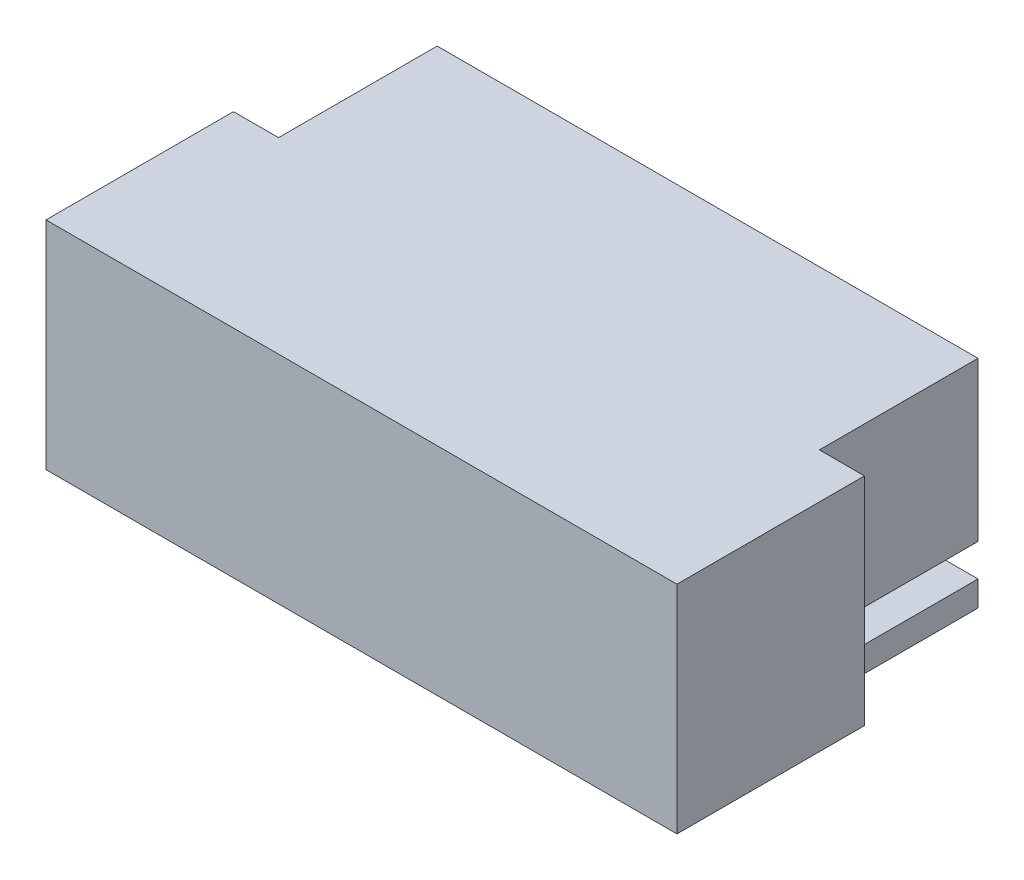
ISO-10303-21;
HEADER;
FILE_DESCRIPTION(('STEP AP214'),'2;1');
FILE_NAME('part.step','',(''),(''),'','','');
FILE_SCHEMA(('AUTOMOTIVE_DESIGN { 1 0 10303 214 1 1 1 1 }'));
ENDSEC;
DATA;
#1=APPLICATION_CONTEXT('core data for automotive mechanical design processes');
#2=APPLICATION_PROTOCOL_DEFINITION('international standard','automotive_design',2000,#1);
#3=PRODUCT_CONTEXT('',#1,'mechanical');
#4=PRODUCT('Part','Part','',(#3));
#5=PRODUCT_RELATED_PRODUCT_CATEGORY('part','',(#4));
#6=PRODUCT_DEFINITION_FORMATION('','',#4);
#7=PRODUCT_DEFINITION_CONTEXT('part definition',#1,'design');
#8=PRODUCT_DEFINITION('design','',#6,#7);
#9=PRODUCT_DEFINITION_SHAPE('','',#8);
#10=(LENGTH_UNIT() NAMED_UNIT(*) SI_UNIT(.MILLI.,.METRE.));
#11=(NAMED_UNIT(*) PLANE_ANGLE_UNIT() SI_UNIT($,.RADIAN.));
#12=(NAMED_UNIT(*) SI_UNIT($,.STERADIAN.) SOLID_ANGLE_UNIT());
#13=UNCERTAINTY_MEASURE_WITH_UNIT(LENGTH_MEASURE(1.E-05),#10,'distance_accuracy_value','');
#14=(GEOMETRIC_REPRESENTATION_CONTEXT(3) GLOBAL_UNCERTAINTY_ASSIGNED_CONTEXT((#13)) GLOBAL_UNIT_ASSIGNED_CONTEXT((#10,
#11,#12)) REPRESENTATION_CONTEXT('',''));
#15=CARTESIAN_POINT('',(0.,0.,0.));
#16=DIRECTION('',(0.,0.,1.));
#17=DIRECTION('',(1.,0.,0.));
#18=AXIS2_PLACEMENT_3D('',#15,#16,#17);
#19=CARTESIAN_POINT('',(-29.35,-25.085,-8.70710678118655));
#20=DIRECTION('',(1.,0.,0.));
#21=DIRECTION('',(0.,0.,-1.));
#22=AXIS2_PLACEMENT_3D('',#19,#20,#21);
#23=PLANE('',#22);
#24=DIRECTION('',(0.,0.,1.));
#25=VECTOR('',#24,1.);
#26=CARTESIAN_POINT('',(-29.35,-25.585,-8.70710678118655));
#27=LINE('',#26,#25);
#28=CARTESIAN_POINT('',(-29.35,-25.585,-6.7));
#29=VERTEX_POINT('',#28);
#30=CARTESIAN_POINT('',(-29.35,-25.585,-3.));
#31=VERTEX_POINT('',#30);
#32=EDGE_CURVE('E321',#29,#31,#27,.T.);
#33=ORIENTED_EDGE('',*,*,#32,.T.);
#34=DIRECTION('',(0.,1.,0.));
#35=VECTOR('',#34,1.);
#36=CARTESIAN_POINT('',(-29.35,-25.085,-3.));
#37=LINE('',#36,#35);
#38=CARTESIAN_POINT('',(-29.35,-25.085,-3.));
#39=VERTEX_POINT('',#38);
#40=EDGE_CURVE('E20',#39,#31,#37,.F.);
#41=ORIENTED_EDGE('',*,*,#40,.F.);
#42=DIRECTION('',(0.,0.,-1.));
#43=VECTOR('',#42,1.);
#44=CARTESIAN_POINT('',(-29.35,-25.085,-8.70710678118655));
#45=LINE('',#44,#43);
#46=CARTESIAN_POINT('',(-29.35,-25.085,-6.7));
#47=VERTEX_POINT('',#46);
#48=EDGE_CURVE('E351',#39,#47,#45,.T.);
#49=ORIENTED_EDGE('',*,*,#48,.T.);
#50=DIRECTION('',(0.,1.,0.));
#51=VECTOR('',#50,1.);
#52=CARTESIAN_POINT('',(-29.35,-25.085,-6.7));
#53=LINE('',#52,#51);
#54=EDGE_CURVE('E316',#29,#47,#53,.T.);
#55=ORIENTED_EDGE('',*,*,#54,.F.);
#56=EDGE_LOOP('',(#33,#41,#49,#55));
#57=FACE_BOUND('',#56,.T.);
#58=ADVANCED_FACE('F17',(#57),#23,.F.);
#59=CARTESIAN_POINT('',(-24.65,-25.085,-8.70710678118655));
#60=DIRECTION('',(1.,0.,0.));
#61=DIRECTION('',(0.,0.,-1.));
#62=AXIS2_PLACEMENT_3D('',#59,#60,#61);
#63=PLANE('',#62);
#64=DIRECTION('',(0.,0.,1.));
#65=VECTOR('',#64,1.);
#66=CARTESIAN_POINT('',(-24.65,-25.585,-8.70710678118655));
#67=LINE('',#66,#65);
#68=CARTESIAN_POINT('',(-24.65,-25.585,-6.7));
#69=VERTEX_POINT('',#68);
#70=CARTESIAN_POINT('',(-24.65,-25.585,-3.));
#71=VERTEX_POINT('',#70);
#72=EDGE_CURVE('E359',#69,#71,#67,.T.);
#73=ORIENTED_EDGE('',*,*,#72,.T.);
#74=DIRECTION('',(0.,1.,0.));
#75=VECTOR('',#74,1.);
#76=CARTESIAN_POINT('',(-24.65,-25.085,-3.));
#77=LINE('',#76,#75);
#78=CARTESIAN_POINT('',(-24.65,-25.085,-3.));
#79=VERTEX_POINT('',#78);
#80=EDGE_CURVE('E343',#79,#71,#77,.F.);
#81=ORIENTED_EDGE('',*,*,#80,.F.);
#82=DIRECTION('',(0.,0.,-1.));
#83=VECTOR('',#82,1.);
#84=CARTESIAN_POINT('',(-24.65,-25.085,-8.70710678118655));
#85=LINE('',#84,#83);
#86=CARTESIAN_POINT('',(-24.65,-25.085,-6.7));
#87=VERTEX_POINT('',#86);
#88=EDGE_CURVE('E369',#79,#87,#85,.T.);
#89=ORIENTED_EDGE('',*,*,#88,.T.);
#90=DIRECTION('',(0.,1.,0.));
#91=VECTOR('',#90,1.);
#92=CARTESIAN_POINT('',(-24.65,-25.085,-6.7));
#93=LINE('',#92,#91);
#94=EDGE_CURVE('E341',#69,#87,#93,.T.);
#95=ORIENTED_EDGE('',*,*,#94,.F.);
#96=EDGE_LOOP('',(#73,#81,#89,#95));
#97=FACE_BOUND('',#96,.T.);
#98=ADVANCED_FACE('F906',(#97),#63,.F.);
#99=CARTESIAN_POINT('',(-22.3,-25.085,-8.70710678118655));
#100=DIRECTION('',(1.,0.,0.));
#101=DIRECTION('',(0.,0.,-1.));
#102=AXIS2_PLACEMENT_3D('',#99,#100,#101);
#103=PLANE('',#102);
#104=DIRECTION('',(0.,0.,1.));
#105=VECTOR('',#104,1.);
#106=CARTESIAN_POINT('',(-22.3,-25.585,-8.70710678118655));
#107=LINE('',#106,#105);
#108=CARTESIAN_POINT('',(-22.3,-25.585,-6.7));
#109=VERTEX_POINT('',#108);
#110=CARTESIAN_POINT('',(-22.3,-25.585,-3.));
#111=VERTEX_POINT('',#110);
#112=EDGE_CURVE('E377',#109,#111,#107,.T.);
#113=ORIENTED_EDGE('',*,*,#112,.T.);
#114=DIRECTION('',(0.,1.,0.));
#115=VECTOR('',#114,1.);
#116=CARTESIAN_POINT('',(-22.3,-25.085,-3.));
#117=LINE('',#116,#115);
#118=CARTESIAN_POINT('',(-22.3,-25.085,-3.));
#119=VERTEX_POINT('',#118);
#120=EDGE_CURVE('E339',#119,#111,#117,.F.);
#121=ORIENTED_EDGE('',*,*,#120,.F.);
#122=DIRECTION('',(0.,0.,-1.));
#123=VECTOR('',#122,1.);
#124=CARTESIAN_POINT('',(-22.3,-25.085,-8.70710678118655));
#125=LINE('',#124,#123);
#126=CARTESIAN_POINT('',(-22.3,-25.085,-6.7));
#127=VERTEX_POINT('',#126);
#128=EDGE_CURVE('E385',#119,#127,#125,.T.);
#129=ORIENTED_EDGE('',*,*,#128,.T.);
#130=DIRECTION('',(0.,1.,0.));
#131=VECTOR('',#130,1.);
#132=CARTESIAN_POINT('',(-22.3,-25.085,-6.7));
#133=LINE('',#132,#131);
#134=EDGE_CURVE('E337',#109,#127,#133,.T.);
#135=ORIENTED_EDGE('',*,*,#134,.F.);
#136=EDGE_LOOP('',(#113,#121,#129,#135));
#137=FACE_BOUND('',#136,.T.);
#138=ADVANCED_FACE('F903',(#137),#103,.F.);
#139=CARTESIAN_POINT('',(-27.,-25.085,-8.70710678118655));
#140=DIRECTION('',(1.,0.,0.));
#141=DIRECTION('',(0.,0.,-1.));
#142=AXIS2_PLACEMENT_3D('',#139,#140,#141);
#143=PLANE('',#142);
#144=DIRECTION('',(0.,0.,1.));
#145=VECTOR('',#144,1.);
#146=CARTESIAN_POINT('',(-27.,-25.585,-8.70710678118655));
#147=LINE('',#146,#145);
#148=CARTESIAN_POINT('',(-27.,-25.585,-6.7));
#149=VERTEX_POINT('',#148);
#150=CARTESIAN_POINT('',(-27.,-25.585,-3.));
#151=VERTEX_POINT('',#150);
#152=EDGE_CURVE('E393',#149,#151,#147,.T.);
#153=ORIENTED_EDGE('',*,*,#152,.T.);
#154=DIRECTION('',(0.,1.,0.));
#155=VECTOR('',#154,1.);
#156=CARTESIAN_POINT('',(-27.,-25.085,-3.));
#157=LINE('',#156,#155);
#158=CARTESIAN_POINT('',(-27.,-25.085,-3.));
#159=VERTEX_POINT('',#158);
#160=EDGE_CURVE('E335',#159,#151,#157,.F.);
#161=ORIENTED_EDGE('',*,*,#160,.F.);
#162=DIRECTION('',(0.,0.,-1.));
#163=VECTOR('',#162,1.);
#164=CARTESIAN_POINT('',(-27.,-25.085,-8.70710678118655));
#165=LINE('',#164,#163);
#166=CARTESIAN_POINT('',(-27.,-25.085,-6.7));
#167=VERTEX_POINT('',#166);
#168=EDGE_CURVE('E401',#159,#167,#165,.T.);
#169=ORIENTED_EDGE('',*,*,#168,.T.);
#170=DIRECTION('',(0.,1.,0.));
#171=VECTOR('',#170,1.);
#172=CARTESIAN_POINT('',(-27.,-25.085,-6.7));
#173=LINE('',#172,#171);
#174=EDGE_CURVE('E333',#149,#167,#173,.T.);
#175=ORIENTED_EDGE('',*,*,#174,.F.);
#176=EDGE_LOOP('',(#153,#161,#169,#175));
#177=FACE_BOUND('',#176,.T.);
#178=ADVANCED_FACE('F899',(#177),#143,.F.);
#179=CARTESIAN_POINT('',(-31.7,-25.085,-8.70710678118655));
#180=DIRECTION('',(1.,0.,0.));
#181=DIRECTION('',(0.,0.,-1.));
#182=AXIS2_PLACEMENT_3D('',#179,#180,#181);
#183=PLANE('',#182);
#184=DIRECTION('',(0.,0.,1.));
#185=VECTOR('',#184,1.);
#186=CARTESIAN_POINT('',(-31.7,-25.585,-8.70710678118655));
#187=LINE('',#186,#185);
#188=CARTESIAN_POINT('',(-31.7,-25.585,-6.7));
#189=VERTEX_POINT('',#188);
#190=CARTESIAN_POINT('',(-31.7,-25.585,-3.));
#191=VERTEX_POINT('',#190);
#192=EDGE_CURVE('E409',#189,#191,#187,.T.);
#193=ORIENTED_EDGE('',*,*,#192,.T.);
#194=DIRECTION('',(0.,1.,0.));
#195=VECTOR('',#194,1.);
#196=CARTESIAN_POINT('',(-31.7,-25.085,-3.));
#197=LINE('',#196,#195);
#198=CARTESIAN_POINT('',(-31.7,-25.085,-3.));
#199=VERTEX_POINT('',#198);
#200=EDGE_CURVE('E328',#199,#191,#197,.F.);
#201=ORIENTED_EDGE('',*,*,#200,.F.);
#202=DIRECTION('',(0.,0.,-1.));
#203=VECTOR('',#202,1.);
#204=CARTESIAN_POINT('',(-31.7,-25.085,-8.70710678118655));
#205=LINE('',#204,#203);
#206=CARTESIAN_POINT('',(-31.7,-25.085,-6.7));
#207=VERTEX_POINT('',#206);
#208=EDGE_CURVE('E417',#199,#207,#205,.T.);
#209=ORIENTED_EDGE('',*,*,#208,.T.);
#210=DIRECTION('',(0.,1.,0.));
#211=VECTOR('',#210,1.);
#212=CARTESIAN_POINT('',(-31.7,-25.085,-6.7));
#213=LINE('',#212,#211);
#214=EDGE_CURVE('E326',#189,#207,#213,.T.);
#215=ORIENTED_EDGE('',*,*,#214,.F.);
#216=EDGE_LOOP('',(#193,#201,#209,#215));
#217=FACE_BOUND('',#216,.T.);
#218=ADVANCED_FACE('F896',(#217),#183,.F.);
#219=CARTESIAN_POINT('',(-28.85,-25.585,-8.70710678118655));
#220=DIRECTION('',(0.,1.,0.));
#221=DIRECTION('',(0.,0.,1.));
#222=AXIS2_PLACEMENT_3D('',#219,#220,#221);
#223=PLANE('',#222);
#224=DIRECTION('',(0.,0.,1.));
#225=VECTOR('',#224,1.);
#226=CARTESIAN_POINT('',(-28.85,-25.585,-8.70710678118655));
#227=LINE('',#226,#225);
#228=CARTESIAN_POINT('',(-28.85,-25.585,-6.7));
#229=VERTEX_POINT('',#228);
#230=CARTESIAN_POINT('',(-28.85,-25.585,-3.));
#231=VERTEX_POINT('',#230);
#232=EDGE_CURVE('E323',#229,#231,#227,.T.);
#233=ORIENTED_EDGE('',*,*,#232,.T.);
#234=DIRECTION('',(1.,0.,0.));
#235=VECTOR('',#234,1.);
#236=CARTESIAN_POINT('',(-28.85,-25.585,-3.));
#237=LINE('',#236,#235);
#238=EDGE_CURVE('E313',#31,#231,#237,.T.);
#239=ORIENTED_EDGE('',*,*,#238,.F.);
#240=ORIENTED_EDGE('',*,*,#32,.F.);
#241=DIRECTION('',(-1.,0.,0.));
#242=VECTOR('',#241,1.);
#243=CARTESIAN_POINT('',(0.,-25.585,-6.7));
#244=LINE('',#243,#242);
#245=EDGE_CURVE('E350',#229,#29,#244,.T.);
#246=ORIENTED_EDGE('',*,*,#245,.F.);
#247=EDGE_LOOP('',(#233,#239,#240,#246));
#248=FACE_BOUND('',#247,.T.);
#249=ADVANCED_FACE('F319',(#248),#223,.F.);
#250=CARTESIAN_POINT('',(-28.85,-25.085,-8.70710678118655));
#251=DIRECTION('',(0.,-1.,0.));
#252=DIRECTION('',(0.,0.,-1.));
#253=AXIS2_PLACEMENT_3D('',#250,#251,#252);
#254=PLANE('',#253);
#255=ORIENTED_EDGE('',*,*,#48,.F.);
#256=DIRECTION('',(1.,0.,0.));
#257=VECTOR('',#256,1.);
#258=CARTESIAN_POINT('',(-28.85,-25.085,-3.));
#259=LINE('',#258,#257);
#260=CARTESIAN_POINT('',(-28.85,-25.085,-3.));
#261=VERTEX_POINT('',#260);
#262=EDGE_CURVE('E315',#261,#39,#259,.F.);
#263=ORIENTED_EDGE('',*,*,#262,.F.);
#264=DIRECTION('',(0.,0.,1.));
#265=VECTOR('',#264,1.);
#266=CARTESIAN_POINT('',(-28.85,-25.085,-8.70710678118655));
#267=LINE('',#266,#265);
#268=CARTESIAN_POINT('',(-28.85,-25.085,-6.7));
#269=VERTEX_POINT('',#268);
#270=EDGE_CURVE('E357',#261,#269,#267,.F.);
#271=ORIENTED_EDGE('',*,*,#270,.T.);
#272=DIRECTION('',(-1.,0.,0.));
#273=VECTOR('',#272,1.);
#274=CARTESIAN_POINT('',(0.,-25.085,-6.7));
#275=LINE('',#274,#273);
#276=EDGE_CURVE('E348',#47,#269,#275,.F.);
#277=ORIENTED_EDGE('',*,*,#276,.F.);
#278=EDGE_LOOP('',(#255,#263,#271,#277));
#279=FACE_BOUND('',#278,.T.);
#280=ADVANCED_FACE('F355',(#279),#254,.F.);
#281=CARTESIAN_POINT('',(0.,0.,-6.7));
#282=DIRECTION('',(0.,0.,-1.));
#283=DIRECTION('',(-1.,0.,0.));
#284=AXIS2_PLACEMENT_3D('',#281,#282,#283);
#285=PLANE('',#284);
#286=ORIENTED_EDGE('',*,*,#245,.T.);
#287=ORIENTED_EDGE('',*,*,#54,.T.);
#288=ORIENTED_EDGE('',*,*,#276,.T.);
#289=DIRECTION('',(0.,1.,0.));
#290=VECTOR('',#289,1.);
#291=CARTESIAN_POINT('',(-28.85,-25.085,-6.7));
#292=LINE('',#291,#290);
#293=EDGE_CURVE('E427',#269,#229,#292,.F.);
#294=ORIENTED_EDGE('',*,*,#293,.T.);
#295=EDGE_LOOP('',(#286,#287,#288,#294));
#296=FACE_BOUND('',#295,.T.);
#297=ADVANCED_FACE('F345',(#296),#285,.T.);
#298=CARTESIAN_POINT('',(-24.15,-25.585,-8.70710678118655));
#299=DIRECTION('',(0.,1.,0.));
#300=DIRECTION('',(0.,0.,1.));
#301=AXIS2_PLACEMENT_3D('',#298,#299,#300);
#302=PLANE('',#301);
#303=DIRECTION('',(0.,0.,1.));
#304=VECTOR('',#303,1.);
#305=CARTESIAN_POINT('',(-24.15,-25.585,-8.70710678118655));
#306=LINE('',#305,#304);
#307=CARTESIAN_POINT('',(-24.15,-25.585,-6.7));
#308=VERTEX_POINT('',#307);
#309=CARTESIAN_POINT('',(-24.15,-25.585,-3.));
#310=VERTEX_POINT('',#309);
#311=EDGE_CURVE('E429',#308,#310,#306,.T.);
#312=ORIENTED_EDGE('',*,*,#311,.T.);
#313=DIRECTION('',(1.,0.,0.));
#314=VECTOR('',#313,1.);
#315=CARTESIAN_POINT('',(-24.15,-25.585,-3.));
#316=LINE('',#315,#314);
#317=EDGE_CURVE('E364',#71,#310,#316,.T.);
#318=ORIENTED_EDGE('',*,*,#317,.F.);
#319=ORIENTED_EDGE('',*,*,#72,.F.);
#320=DIRECTION('',(-1.,0.,0.));
#321=VECTOR('',#320,1.);
#322=CARTESIAN_POINT('',(0.,-25.585,-6.7));
#323=LINE('',#322,#321);
#324=EDGE_CURVE('E374',#308,#69,#323,.T.);
#325=ORIENTED_EDGE('',*,*,#324,.F.);
#326=EDGE_LOOP('',(#312,#318,#319,#325));
#327=FACE_BOUND('',#326,.T.);
#328=ADVANCED_FACE('F885',(#327),#302,.F.);
#329=CARTESIAN_POINT('',(-24.15,-25.085,-8.70710678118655));
#330=DIRECTION('',(0.,-1.,0.));
#331=DIRECTION('',(0.,0.,-1.));
#332=AXIS2_PLACEMENT_3D('',#329,#330,#331);
#333=PLANE('',#332);
#334=ORIENTED_EDGE('',*,*,#88,.F.);
#335=DIRECTION('',(1.,0.,0.));
#336=VECTOR('',#335,1.);
#337=CARTESIAN_POINT('',(-24.15,-25.085,-3.));
#338=LINE('',#337,#336);
#339=CARTESIAN_POINT('',(-24.15,-25.085,-3.));
#340=VERTEX_POINT('',#339);
#341=EDGE_CURVE('E366',#340,#79,#338,.F.);
#342=ORIENTED_EDGE('',*,*,#341,.F.);
#343=DIRECTION('',(0.,0.,1.));
#344=VECTOR('',#343,1.);
#345=CARTESIAN_POINT('',(-24.15,-25.085,-8.70710678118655));
#346=LINE('',#345,#344);
#347=CARTESIAN_POINT('',(-24.15,-25.085,-6.7));
#348=VERTEX_POINT('',#347);
#349=EDGE_CURVE('E432',#340,#348,#346,.F.);
#350=ORIENTED_EDGE('',*,*,#349,.T.);
#351=DIRECTION('',(-1.,0.,0.));
#352=VECTOR('',#351,1.);
#353=CARTESIAN_POINT('',(0.,-25.085,-6.7));
#354=LINE('',#353,#352);
#355=EDGE_CURVE('E372',#87,#348,#354,.F.);
#356=ORIENTED_EDGE('',*,*,#355,.F.);
#357=EDGE_LOOP('',(#334,#342,#350,#356));
#358=FACE_BOUND('',#357,.T.);
#359=ADVANCED_FACE('F881',(#358),#333,.F.);
#360=CARTESIAN_POINT('',(0.,0.,-6.7));
#361=DIRECTION('',(0.,0.,-1.));
#362=DIRECTION('',(-1.,0.,0.));
#363=AXIS2_PLACEMENT_3D('',#360,#361,#362);
#364=PLANE('',#363);
#365=ORIENTED_EDGE('',*,*,#324,.T.);
#366=ORIENTED_EDGE('',*,*,#94,.T.);
#367=ORIENTED_EDGE('',*,*,#355,.T.);
#368=DIRECTION('',(0.,-1.,0.));
#369=VECTOR('',#368,1.);
#370=CARTESIAN_POINT('',(-24.15,-25.085,-6.7));
#371=LINE('',#370,#369);
#372=EDGE_CURVE('E435',#348,#308,#371,.T.);
#373=ORIENTED_EDGE('',*,*,#372,.T.);
#374=EDGE_LOOP('',(#365,#366,#367,#373));
#375=FACE_BOUND('',#374,.T.);
#376=ADVANCED_FACE('F877',(#375),#364,.T.);
#377=CARTESIAN_POINT('',(-21.8,-25.585,-8.70710678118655));
#378=DIRECTION('',(0.,1.,0.));
#379=DIRECTION('',(0.,0.,1.));
#380=AXIS2_PLACEMENT_3D('',#377,#378,#379);
#381=PLANE('',#380);
#382=DIRECTION('',(0.,0.,1.));
#383=VECTOR('',#382,1.);
#384=CARTESIAN_POINT('',(-21.8,-25.585,-8.70710678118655));
#385=LINE('',#384,#383);
#386=CARTESIAN_POINT('',(-21.8,-25.585,-6.7));
#387=VERTEX_POINT('',#386);
#388=CARTESIAN_POINT('',(-21.8,-25.585,-3.));
#389=VERTEX_POINT('',#388);
#390=EDGE_CURVE('E438',#387,#389,#385,.T.);
#391=ORIENTED_EDGE('',*,*,#390,.T.);
#392=DIRECTION('',(1.,0.,0.));
#393=VECTOR('',#392,1.);
#394=CARTESIAN_POINT('',(-21.8,-25.585,-3.));
#395=LINE('',#394,#393);
#396=EDGE_CURVE('E380',#111,#389,#395,.T.);
#397=ORIENTED_EDGE('',*,*,#396,.F.);
#398=ORIENTED_EDGE('',*,*,#112,.F.);
#399=DIRECTION('',(-1.,0.,0.));
#400=VECTOR('',#399,1.);
#401=CARTESIAN_POINT('',(0.,-25.585,-6.7));
#402=LINE('',#401,#400);
#403=EDGE_CURVE('E390',#387,#109,#402,.T.);
#404=ORIENTED_EDGE('',*,*,#403,.F.);
#405=EDGE_LOOP('',(#391,#397,#398,#404));
#406=FACE_BOUND('',#405,.T.);
#407=ADVANCED_FACE('F873',(#406),#381,.F.);
#408=CARTESIAN_POINT('',(-21.8,-25.085,-8.70710678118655));
#409=DIRECTION('',(0.,-1.,0.));
#410=DIRECTION('',(0.,0.,-1.));
#411=AXIS2_PLACEMENT_3D('',#408,#409,#410);
#412=PLANE('',#411);
#413=ORIENTED_EDGE('',*,*,#128,.F.);
#414=DIRECTION('',(1.,0.,0.));
#415=VECTOR('',#414,1.);
#416=CARTESIAN_POINT('',(-21.8,-25.085,-3.));
#417=LINE('',#416,#415);
#418=CARTESIAN_POINT('',(-21.8,-25.085,-3.));
#419=VERTEX_POINT('',#418);
#420=EDGE_CURVE('E382',#419,#119,#417,.F.);
#421=ORIENTED_EDGE('',*,*,#420,.F.);
#422=DIRECTION('',(0.,0.,1.));
#423=VECTOR('',#422,1.);
#424=CARTESIAN_POINT('',(-21.8,-25.085,-8.70710678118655));
#425=LINE('',#424,#423);
#426=CARTESIAN_POINT('',(-21.8,-25.085,-6.7));
#427=VERTEX_POINT('',#426);
#428=EDGE_CURVE('E441',#419,#427,#425,.F.);
#429=ORIENTED_EDGE('',*,*,#428,.T.);
#430=DIRECTION('',(-1.,0.,0.));
#431=VECTOR('',#430,1.);
#432=CARTESIAN_POINT('',(0.,-25.085,-6.7));
#433=LINE('',#432,#431);
#434=EDGE_CURVE('E388',#127,#427,#433,.F.);
#435=ORIENTED_EDGE('',*,*,#434,.F.);
#436=EDGE_LOOP('',(#413,#421,#429,#435));
#437=FACE_BOUND('',#436,.T.);
#438=ADVANCED_FACE('F869',(#437),#412,.F.);
#439=CARTESIAN_POINT('',(0.,0.,-6.7));
#440=DIRECTION('',(0.,0.,-1.));
#441=DIRECTION('',(-1.,0.,0.));
#442=AXIS2_PLACEMENT_3D('',#439,#440,#441);
#443=PLANE('',#442);
#444=ORIENTED_EDGE('',*,*,#403,.T.);
#445=ORIENTED_EDGE('',*,*,#134,.T.);
#446=ORIENTED_EDGE('',*,*,#434,.T.);
#447=DIRECTION('',(0.,1.,0.));
#448=VECTOR('',#447,1.);
#449=CARTESIAN_POINT('',(-21.8,-25.085,-6.7));
#450=LINE('',#449,#448);
#451=EDGE_CURVE('E444',#427,#387,#450,.F.);
#452=ORIENTED_EDGE('',*,*,#451,.T.);
#453=EDGE_LOOP('',(#444,#445,#446,#452));
#454=FACE_BOUND('',#453,.T.);
#455=ADVANCED_FACE('F865',(#454),#443,.T.);
#456=CARTESIAN_POINT('',(-26.5,-25.585,-8.70710678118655));
#457=DIRECTION('',(0.,1.,0.));
#458=DIRECTION('',(0.,0.,1.));
#459=AXIS2_PLACEMENT_3D('',#456,#457,#458);
#460=PLANE('',#459);
#461=DIRECTION('',(0.,0.,1.));
#462=VECTOR('',#461,1.);
#463=CARTESIAN_POINT('',(-26.5,-25.585,-8.70710678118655));
#464=LINE('',#463,#462);
#465=CARTESIAN_POINT('',(-26.5,-25.585,-6.7));
#466=VERTEX_POINT('',#465);
#467=CARTESIAN_POINT('',(-26.5,-25.585,-3.));
#468=VERTEX_POINT('',#467);
#469=EDGE_CURVE('E447',#466,#468,#464,.T.);
#470=ORIENTED_EDGE('',*,*,#469,.T.);
#471=DIRECTION('',(1.,0.,0.));
#472=VECTOR('',#471,1.);
#473=CARTESIAN_POINT('',(-26.5,-25.585,-3.));
#474=LINE('',#473,#472);
#475=EDGE_CURVE('E396',#151,#468,#474,.T.);
#476=ORIENTED_EDGE('',*,*,#475,.F.);
#477=ORIENTED_EDGE('',*,*,#152,.F.);
#478=DIRECTION('',(-1.,0.,0.));
#479=VECTOR('',#478,1.);
#480=CARTESIAN_POINT('',(0.,-25.585,-6.7));
#481=LINE('',#480,#479);
#482=EDGE_CURVE('E406',#466,#149,#481,.T.);
#483=ORIENTED_EDGE('',*,*,#482,.F.);
#484=EDGE_LOOP('',(#470,#476,#477,#483));
#485=FACE_BOUND('',#484,.T.);
#486=ADVANCED_FACE('F861',(#485),#460,.F.);
#487=CARTESIAN_POINT('',(-26.5,-25.085,-8.70710678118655));
#488=DIRECTION('',(0.,-1.,0.));
#489=DIRECTION('',(0.,0.,-1.));
#490=AXIS2_PLACEMENT_3D('',#487,#488,#489);
#491=PLANE('',#490);
#492=ORIENTED_EDGE('',*,*,#168,.F.);
#493=DIRECTION('',(1.,0.,0.));
#494=VECTOR('',#493,1.);
#495=CARTESIAN_POINT('',(-26.5,-25.085,-3.));
#496=LINE('',#495,#494);
#497=CARTESIAN_POINT('',(-26.5,-25.085,-3.));
#498=VERTEX_POINT('',#497);
#499=EDGE_CURVE('E398',#498,#159,#496,.F.);
#500=ORIENTED_EDGE('',*,*,#499,.F.);
#501=DIRECTION('',(0.,0.,1.));
#502=VECTOR('',#501,1.);
#503=CARTESIAN_POINT('',(-26.5,-25.085,-8.70710678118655));
#504=LINE('',#503,#502);
#505=CARTESIAN_POINT('',(-26.5,-25.085,-6.7));
#506=VERTEX_POINT('',#505);
#507=EDGE_CURVE('E450',#498,#506,#504,.F.);
#508=ORIENTED_EDGE('',*,*,#507,.T.);
#509=DIRECTION('',(-1.,0.,0.));
#510=VECTOR('',#509,1.);
#511=CARTESIAN_POINT('',(0.,-25.085,-6.7));
#512=LINE('',#511,#510);
#513=EDGE_CURVE('E404',#167,#506,#512,.F.);
#514=ORIENTED_EDGE('',*,*,#513,.F.);
#515=EDGE_LOOP('',(#492,#500,#508,#514));
#516=FACE_BOUND('',#515,.T.);
#517=ADVANCED_FACE('F857',(#516),#491,.F.);
#518=CARTESIAN_POINT('',(0.,0.,-6.7));
#519=DIRECTION('',(0.,0.,-1.));
#520=DIRECTION('',(-1.,0.,0.));
#521=AXIS2_PLACEMENT_3D('',#518,#519,#520);
#522=PLANE('',#521);
#523=ORIENTED_EDGE('',*,*,#482,.T.);
#524=ORIENTED_EDGE('',*,*,#174,.T.);
#525=ORIENTED_EDGE('',*,*,#513,.T.);
#526=DIRECTION('',(0.,1.,0.));
#527=VECTOR('',#526,1.);
#528=CARTESIAN_POINT('',(-26.5,-25.085,-6.7));
#529=LINE('',#528,#527);
#530=EDGE_CURVE('E453',#506,#466,#529,.F.);
#531=ORIENTED_EDGE('',*,*,#530,.T.);
#532=EDGE_LOOP('',(#523,#524,#525,#531));
#533=FACE_BOUND('',#532,.T.);
#534=ADVANCED_FACE('F853',(#533),#522,.T.);
#535=CARTESIAN_POINT('',(-31.2,-25.585,-8.70710678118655));
#536=DIRECTION('',(0.,1.,0.));
#537=DIRECTION('',(0.,0.,1.));
#538=AXIS2_PLACEMENT_3D('',#535,#536,#537);
#539=PLANE('',#538);
#540=DIRECTION('',(0.,0.,1.));
#541=VECTOR('',#540,1.);
#542=CARTESIAN_POINT('',(-31.2,-25.585,-8.70710678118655));
#543=LINE('',#542,#541);
#544=CARTESIAN_POINT('',(-31.2,-25.585,-6.7));
#545=VERTEX_POINT('',#544);
#546=CARTESIAN_POINT('',(-31.2,-25.585,-3.));
#547=VERTEX_POINT('',#546);
#548=EDGE_CURVE('E456',#545,#547,#543,.T.);
#549=ORIENTED_EDGE('',*,*,#548,.T.);
#550=DIRECTION('',(1.,0.,0.));
#551=VECTOR('',#550,1.);
#552=CARTESIAN_POINT('',(-31.2,-25.585,-3.));
#553=LINE('',#552,#551);
#554=EDGE_CURVE('E412',#191,#547,#553,.T.);
#555=ORIENTED_EDGE('',*,*,#554,.F.);
#556=ORIENTED_EDGE('',*,*,#192,.F.);
#557=DIRECTION('',(-1.,0.,0.));
#558=VECTOR('',#557,1.);
#559=CARTESIAN_POINT('',(0.,-25.585,-6.7));
#560=LINE('',#559,#558);
#561=EDGE_CURVE('E422',#545,#189,#560,.T.);
#562=ORIENTED_EDGE('',*,*,#561,.F.);
#563=EDGE_LOOP('',(#549,#555,#556,#562));
#564=FACE_BOUND('',#563,.T.);
#565=ADVANCED_FACE('F849',(#564),#539,.F.);
#566=CARTESIAN_POINT('',(-31.2,-25.085,-8.70710678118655));
#567=DIRECTION('',(0.,-1.,0.));
#568=DIRECTION('',(0.,0.,-1.));
#569=AXIS2_PLACEMENT_3D('',#566,#567,#568);
#570=PLANE('',#569);
#571=ORIENTED_EDGE('',*,*,#208,.F.);
#572=DIRECTION('',(1.,0.,0.));
#573=VECTOR('',#572,1.);
#574=CARTESIAN_POINT('',(-31.2,-25.085,-3.));
#575=LINE('',#574,#573);
#576=CARTESIAN_POINT('',(-31.2,-25.085,-3.));
#577=VERTEX_POINT('',#576);
#578=EDGE_CURVE('E414',#577,#199,#575,.F.);
#579=ORIENTED_EDGE('',*,*,#578,.F.);
#580=DIRECTION('',(0.,0.,1.));
#581=VECTOR('',#580,1.);
#582=CARTESIAN_POINT('',(-31.2,-25.085,-8.70710678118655));
#583=LINE('',#582,#581);
#584=CARTESIAN_POINT('',(-31.2,-25.085,-6.7));
#585=VERTEX_POINT('',#584);
#586=EDGE_CURVE('E459',#577,#585,#583,.F.);
#587=ORIENTED_EDGE('',*,*,#586,.T.);
#588=DIRECTION('',(-1.,0.,0.));
#589=VECTOR('',#588,1.);
#590=CARTESIAN_POINT('',(0.,-25.085,-6.7));
#591=LINE('',#590,#589);
#592=EDGE_CURVE('E420',#207,#585,#591,.F.);
#593=ORIENTED_EDGE('',*,*,#592,.F.);
#594=EDGE_LOOP('',(#571,#579,#587,#593));
#595=FACE_BOUND('',#594,.T.);
#596=ADVANCED_FACE('F845',(#595),#570,.F.);
#597=CARTESIAN_POINT('',(0.,0.,-6.7));
#598=DIRECTION('',(0.,0.,-1.));
#599=DIRECTION('',(-1.,0.,0.));
#600=AXIS2_PLACEMENT_3D('',#597,#598,#599);
#601=PLANE('',#600);
#602=ORIENTED_EDGE('',*,*,#561,.T.);
#603=ORIENTED_EDGE('',*,*,#214,.T.);
#604=ORIENTED_EDGE('',*,*,#592,.T.);
#605=DIRECTION('',(0.,1.,0.));
#606=VECTOR('',#605,1.);
#607=CARTESIAN_POINT('',(-31.2,-25.085,-6.7));
#608=LINE('',#607,#606);
#609=EDGE_CURVE('E462',#585,#545,#608,.F.);
#610=ORIENTED_EDGE('',*,*,#609,.T.);
#611=EDGE_LOOP('',(#602,#603,#604,#610));
#612=FACE_BOUND('',#611,.T.);
#613=ADVANCED_FACE('F841',(#612),#601,.T.);
#614=CARTESIAN_POINT('',(-28.85,-25.085,-8.70710678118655));
#615=DIRECTION('',(-1.,0.,0.));
#616=DIRECTION('',(0.,0.,1.));
#617=AXIS2_PLACEMENT_3D('',#614,#615,#616);
#618=PLANE('',#617);
#619=ORIENTED_EDGE('',*,*,#270,.F.);
#620=DIRECTION('',(0.,1.,0.));
#621=VECTOR('',#620,1.);
#622=CARTESIAN_POINT('',(-28.85,0.,-3.));
#623=LINE('',#622,#621);
#624=EDGE_CURVE('E499',#261,#231,#623,.F.);
#625=ORIENTED_EDGE('',*,*,#624,.T.);
#626=ORIENTED_EDGE('',*,*,#232,.F.);
#627=ORIENTED_EDGE('',*,*,#293,.F.);
#628=EDGE_LOOP('',(#619,#625,#626,#627));
#629=FACE_BOUND('',#628,.T.);
#630=ADVANCED_FACE('F837',(#629),#618,.F.);
#631=CARTESIAN_POINT('',(-24.15,-25.085,-8.70710678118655));
#632=DIRECTION('',(-1.,0.,0.));
#633=DIRECTION('',(0.,-1.,0.));
#634=AXIS2_PLACEMENT_3D('',#631,#632,#633);
#635=PLANE('',#634);
#636=ORIENTED_EDGE('',*,*,#349,.F.);
#637=DIRECTION('',(0.,1.,0.));
#638=VECTOR('',#637,1.);
#639=CARTESIAN_POINT('',(-24.15,0.,-3.));
#640=LINE('',#639,#638);
#641=EDGE_CURVE('E501',#340,#310,#640,.F.);
#642=ORIENTED_EDGE('',*,*,#641,.T.);
#643=ORIENTED_EDGE('',*,*,#311,.F.);
#644=ORIENTED_EDGE('',*,*,#372,.F.);
#645=EDGE_LOOP('',(#636,#642,#643,#644));
#646=FACE_BOUND('',#645,.T.);
#647=ADVANCED_FACE('F833',(#646),#635,.F.);
#648=CARTESIAN_POINT('',(-30.5,-26.485,-3.));
#649=DIRECTION('',(0.,-1.,0.));
#650=DIRECTION('',(0.,0.,-1.));
#651=AXIS2_PLACEMENT_3D('',#648,#649,#650);
#652=PLANE('',#651);
#653=DIRECTION('',(0.,0.,-1.));
#654=VECTOR('',#653,1.);
#655=CARTESIAN_POINT('',(-30.5,-26.485,-3.));
#656=LINE('',#655,#654);
#657=CARTESIAN_POINT('',(-30.5,-26.485,-8.));
#658=VERTEX_POINT('',#657);
#659=CARTESIAN_POINT('',(-30.5,-26.485,-3.));
#660=VERTEX_POINT('',#659);
#661=EDGE_CURVE('E494',#658,#660,#656,.F.);
#662=ORIENTED_EDGE('',*,*,#661,.T.);
#663=DIRECTION('',(1.,0.,0.));
#664=VECTOR('',#663,1.);
#665=CARTESIAN_POINT('',(0.,-26.485,-3.));
#666=LINE('',#665,#664);
#667=CARTESIAN_POINT('',(-23.,-26.485,-3.));
#668=VERTEX_POINT('',#667);
#669=EDGE_CURVE('E509',#660,#668,#666,.T.);
#670=ORIENTED_EDGE('',*,*,#669,.T.);
#671=DIRECTION('',(0.,0.,1.));
#672=VECTOR('',#671,1.);
#673=CARTESIAN_POINT('',(-23.,-26.485,-3.));
#674=LINE('',#673,#672);
#675=CARTESIAN_POINT('',(-23.,-26.485,-8.));
#676=VERTEX_POINT('',#675);
#677=EDGE_CURVE('E487',#668,#676,#674,.F.);
#678=ORIENTED_EDGE('',*,*,#677,.T.);
#679=DIRECTION('',(-1.,0.,0.));
#680=VECTOR('',#679,1.);
#681=CARTESIAN_POINT('',(0.,-26.485,-8.));
#682=LINE('',#681,#680);
#683=EDGE_CURVE('E490',#658,#676,#682,.F.);
#684=ORIENTED_EDGE('',*,*,#683,.F.);
#685=EDGE_LOOP('',(#662,#670,#678,#684));
#686=FACE_BOUND('',#685,.T.);
#687=ADVANCED_FACE('F829',(#686),#652,.F.);
#688=CARTESIAN_POINT('',(-19.95,-26.485,-3.));
#689=DIRECTION('',(0.,-1.,0.));
#690=DIRECTION('',(0.,0.,-1.));
#691=AXIS2_PLACEMENT_3D('',#688,#689,#690);
#692=PLANE('',#691);
#693=DIRECTION('',(0.,0.,-1.));
#694=VECTOR('',#693,1.);
#695=CARTESIAN_POINT('',(-21.2,-26.485,-3.));
#696=LINE('',#695,#694);
#697=CARTESIAN_POINT('',(-21.2,-26.485,-8.));
#698=VERTEX_POINT('',#697);
#699=CARTESIAN_POINT('',(-21.2,-26.485,-3.));
#700=VERTEX_POINT('',#699);
#701=EDGE_CURVE('E482',#698,#700,#696,.F.);
#702=ORIENTED_EDGE('',*,*,#701,.T.);
#703=DIRECTION('',(1.,0.,0.));
#704=VECTOR('',#703,1.);
#705=CARTESIAN_POINT('',(0.,-26.485,-3.));
#706=LINE('',#705,#704);
#707=CARTESIAN_POINT('',(-19.25,-26.485,-3.));
#708=VERTEX_POINT('',#707);
#709=EDGE_CURVE('E517',#700,#708,#706,.T.);
#710=ORIENTED_EDGE('',*,*,#709,.T.);
#711=DIRECTION('',(0.,0.,-1.));
#712=VECTOR('',#711,1.);
#713=CARTESIAN_POINT('',(-19.25,-26.485,-3.));
#714=LINE('',#713,#712);
#715=CARTESIAN_POINT('',(-19.25,-26.485,-3.6));
#716=VERTEX_POINT('',#715);
#717=EDGE_CURVE('E467',#708,#716,#714,.T.);
#718=ORIENTED_EDGE('',*,*,#717,.T.);
#719=DIRECTION('',(0.,0.,1.));
#720=VECTOR('',#719,1.);
#721=CARTESIAN_POINT('',(-19.25,-26.485,-3.6));
#722=LINE('',#721,#720);
#723=CARTESIAN_POINT('',(-19.25,-26.485,-8.));
#724=VERTEX_POINT('',#723);
#725=EDGE_CURVE('E475',#716,#724,#722,.F.);
#726=ORIENTED_EDGE('',*,*,#725,.T.);
#727=DIRECTION('',(-1.,0.,0.));
#728=VECTOR('',#727,1.);
#729=CARTESIAN_POINT('',(0.,-26.485,-8.));
#730=LINE('',#729,#728);
#731=EDGE_CURVE('E478',#698,#724,#730,.F.);
#732=ORIENTED_EDGE('',*,*,#731,.F.);
#733=EDGE_LOOP('',(#702,#710,#718,#726,#732));
#734=FACE_BOUND('',#733,.T.);
#735=ADVANCED_FACE('F825',(#734),#692,.F.);
#736=CARTESIAN_POINT('',(-21.8,-25.085,-8.70710678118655));
#737=DIRECTION('',(-1.,0.,0.));
#738=DIRECTION('',(0.,0.,1.));
#739=AXIS2_PLACEMENT_3D('',#736,#737,#738);
#740=PLANE('',#739);
#741=ORIENTED_EDGE('',*,*,#428,.F.);
#742=DIRECTION('',(0.,1.,0.));
#743=VECTOR('',#742,1.);
#744=CARTESIAN_POINT('',(-21.8,0.,-3.));
#745=LINE('',#744,#743);
#746=EDGE_CURVE('E522',#419,#389,#745,.F.);
#747=ORIENTED_EDGE('',*,*,#746,.T.);
#748=ORIENTED_EDGE('',*,*,#390,.F.);
#749=ORIENTED_EDGE('',*,*,#451,.F.);
#750=EDGE_LOOP('',(#741,#747,#748,#749));
#751=FACE_BOUND('',#750,.T.);
#752=ADVANCED_FACE('F821',(#751),#740,.F.);
#753=CARTESIAN_POINT('',(-26.5,-25.085,-8.70710678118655));
#754=DIRECTION('',(-1.,0.,0.));
#755=DIRECTION('',(0.,0.,1.));
#756=AXIS2_PLACEMENT_3D('',#753,#754,#755);
#757=PLANE('',#756);
#758=ORIENTED_EDGE('',*,*,#507,.F.);
#759=DIRECTION('',(0.,1.,0.));
#760=VECTOR('',#759,1.);
#761=CARTESIAN_POINT('',(-26.5,0.,-3.));
#762=LINE('',#761,#760);
#763=EDGE_CURVE('E525',#498,#468,#762,.F.);
#764=ORIENTED_EDGE('',*,*,#763,.T.);
#765=ORIENTED_EDGE('',*,*,#469,.F.);
#766=ORIENTED_EDGE('',*,*,#530,.F.);
#767=EDGE_LOOP('',(#758,#764,#765,#766));
#768=FACE_BOUND('',#767,.T.);
#769=ADVANCED_FACE('F817',(#768),#757,.F.);
#770=CARTESIAN_POINT('',(-31.2,-25.085,-8.70710678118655));
#771=DIRECTION('',(-1.,0.,0.));
#772=DIRECTION('',(0.,0.,1.));
#773=AXIS2_PLACEMENT_3D('',#770,#771,#772);
#774=PLANE('',#773);
#775=ORIENTED_EDGE('',*,*,#586,.F.);
#776=DIRECTION('',(0.,1.,0.));
#777=VECTOR('',#776,1.);
#778=CARTESIAN_POINT('',(-31.2,0.,-3.));
#779=LINE('',#778,#777);
#780=EDGE_CURVE('E528',#577,#547,#779,.F.);
#781=ORIENTED_EDGE('',*,*,#780,.T.);
#782=ORIENTED_EDGE('',*,*,#548,.F.);
#783=ORIENTED_EDGE('',*,*,#609,.F.);
#784=EDGE_LOOP('',(#775,#781,#782,#783));
#785=FACE_BOUND('',#784,.T.);
#786=ADVANCED_FACE('F813',(#785),#774,.F.);
#787=CARTESIAN_POINT('',(-33.55,-26.485,-3.));
#788=DIRECTION('',(0.,-1.,0.));
#789=DIRECTION('',(0.,0.,-1.));
#790=AXIS2_PLACEMENT_3D('',#787,#788,#789);
#791=PLANE('',#790);
#792=DIRECTION('',(0.,0.,-1.));
#793=VECTOR('',#792,1.);
#794=CARTESIAN_POINT('',(-34.25,-26.485,-3.6));
#795=LINE('',#794,#793);
#796=CARTESIAN_POINT('',(-34.25,-26.485,-8.));
#797=VERTEX_POINT('',#796);
#798=CARTESIAN_POINT('',(-34.25,-26.485,-3.6));
#799=VERTEX_POINT('',#798);
#800=EDGE_CURVE('E470',#797,#799,#795,.F.);
#801=ORIENTED_EDGE('',*,*,#800,.T.);
#802=DIRECTION('',(0.,0.,-1.));
#803=VECTOR('',#802,1.);
#804=CARTESIAN_POINT('',(-34.25,-26.485,-3.));
#805=LINE('',#804,#803);
#806=CARTESIAN_POINT('',(-34.25,-26.485,-3.));
#807=VERTEX_POINT('',#806);
#808=EDGE_CURVE('E465',#807,#799,#805,.T.);
#809=ORIENTED_EDGE('',*,*,#808,.F.);
#810=DIRECTION('',(1.,0.,0.));
#811=VECTOR('',#810,1.);
#812=CARTESIAN_POINT('',(0.,-26.485,-3.));
#813=LINE('',#812,#811);
#814=CARTESIAN_POINT('',(-32.3,-26.485,-3.));
#815=VERTEX_POINT('',#814);
#816=EDGE_CURVE('E504',#807,#815,#813,.T.);
#817=ORIENTED_EDGE('',*,*,#816,.T.);
#818=DIRECTION('',(0.,0.,1.));
#819=VECTOR('',#818,1.);
#820=CARTESIAN_POINT('',(-32.3,-26.485,-3.));
#821=LINE('',#820,#819);
#822=CARTESIAN_POINT('',(-32.3,-26.485,-8.));
#823=VERTEX_POINT('',#822);
#824=EDGE_CURVE('E534',#815,#823,#821,.F.);
#825=ORIENTED_EDGE('',*,*,#824,.T.);
#826=DIRECTION('',(-1.,0.,0.));
#827=VECTOR('',#826,1.);
#828=CARTESIAN_POINT('',(0.,-26.485,-8.));
#829=LINE('',#828,#827);
#830=EDGE_CURVE('E537',#797,#823,#829,.F.);
#831=ORIENTED_EDGE('',*,*,#830,.F.);
#832=EDGE_LOOP('',(#801,#809,#817,#825,#831));
#833=FACE_BOUND('',#832,.T.);
#834=ADVANCED_FACE('F809',(#833),#791,.F.);
#835=CARTESIAN_POINT('',(-19.25,-25.585,-3.));
#836=DIRECTION('',(1.,0.,0.));
#837=DIRECTION('',(0.,0.,-1.));
#838=AXIS2_PLACEMENT_3D('',#835,#836,#837);
#839=PLANE('',#838);
#840=ORIENTED_EDGE('',*,*,#717,.F.);
#841=DIRECTION('',(0.,1.,0.));
#842=VECTOR('',#841,1.);
#843=CARTESIAN_POINT('',(-19.25,0.,-3.));
#844=LINE('',#843,#842);
#845=CARTESIAN_POINT('',(-19.25,-25.585,-3.));
#846=VERTEX_POINT('',#845);
#847=EDGE_CURVE('E520',#708,#846,#844,.T.);
#848=ORIENTED_EDGE('',*,*,#847,.T.);
#849=DIRECTION('',(0.,0.,1.));
#850=VECTOR('',#849,1.);
#851=CARTESIAN_POINT('',(-19.25,-25.585,-3.));
#852=LINE('',#851,#850);
#853=CARTESIAN_POINT('',(-19.25,-25.585,-3.6));
#854=VERTEX_POINT('',#853);
#855=EDGE_CURVE('E576',#846,#854,#852,.F.);
#856=ORIENTED_EDGE('',*,*,#855,.T.);
#857=DIRECTION('',(0.,1.,0.));
#858=VECTOR('',#857,1.);
#859=CARTESIAN_POINT('',(-19.25,0.,-3.6));
#860=LINE('',#859,#858);
#861=EDGE_CURVE('E582',#716,#854,#860,.T.);
#862=ORIENTED_EDGE('',*,*,#861,.F.);
#863=EDGE_LOOP('',(#840,#848,#856,#862));
#864=FACE_BOUND('',#863,.T.);
#865=ADVANCED_FACE('F805',(#864),#839,.F.);
#866=CARTESIAN_POINT('',(-34.25,-21.185,-3.6));
#867=DIRECTION('',(1.,0.,0.));
#868=DIRECTION('',(0.,0.,-1.));
#869=AXIS2_PLACEMENT_3D('',#866,#867,#868);
#870=PLANE('',#869);
#871=ORIENTED_EDGE('',*,*,#800,.F.);
#872=DIRECTION('',(0.,1.,0.));
#873=VECTOR('',#872,1.);
#874=CARTESIAN_POINT('',(-34.25,0.,-8.));
#875=LINE('',#874,#873);
#876=CARTESIAN_POINT('',(-34.25,-27.185,-8.));
#877=VERTEX_POINT('',#876);
#878=EDGE_CURVE('E541',#877,#797,#875,.T.);
#879=ORIENTED_EDGE('',*,*,#878,.F.);
#880=DIRECTION('',(0.,0.,1.));
#881=VECTOR('',#880,1.);
#882=CARTESIAN_POINT('',(-34.25,-27.185,-8.));
#883=LINE('',#882,#881);
#884=CARTESIAN_POINT('',(-34.25,-27.185,-3.6));
#885=VERTEX_POINT('',#884);
#886=EDGE_CURVE('E586',#877,#885,#883,.T.);
#887=ORIENTED_EDGE('',*,*,#886,.T.);
#888=DIRECTION('',(0.,1.,0.));
#889=VECTOR('',#888,1.);
#890=CARTESIAN_POINT('',(-34.25,-21.185,-3.6));
#891=LINE('',#890,#889);
#892=EDGE_CURVE('E473',#799,#885,#891,.F.);
#893=ORIENTED_EDGE('',*,*,#892,.F.);
#894=EDGE_LOOP('',(#871,#879,#887,#893));
#895=FACE_BOUND('',#894,.T.);
#896=ADVANCED_FACE('F801',(#895),#870,.F.);
#897=CARTESIAN_POINT('',(-19.25,-21.185,-3.6));
#898=DIRECTION('',(-1.,0.,0.));
#899=DIRECTION('',(0.,0.,1.));
#900=AXIS2_PLACEMENT_3D('',#897,#898,#899);
#901=PLANE('',#900);
#902=ORIENTED_EDGE('',*,*,#725,.F.);
#903=DIRECTION('',(0.,1.,0.));
#904=VECTOR('',#903,1.);
#905=CARTESIAN_POINT('',(-19.25,0.,-3.6));
#906=LINE('',#905,#904);
#907=CARTESIAN_POINT('',(-19.25,-27.185,-3.6));
#908=VERTEX_POINT('',#907);
#909=EDGE_CURVE('E579',#908,#716,#906,.T.);
#910=ORIENTED_EDGE('',*,*,#909,.F.);
#911=DIRECTION('',(0.,0.,1.));
#912=VECTOR('',#911,1.);
#913=CARTESIAN_POINT('',(-19.25,-27.185,-8.));
#914=LINE('',#913,#912);
#915=CARTESIAN_POINT('',(-19.25,-27.185,-8.));
#916=VERTEX_POINT('',#915);
#917=EDGE_CURVE('E592',#908,#916,#914,.F.);
#918=ORIENTED_EDGE('',*,*,#917,.T.);
#919=DIRECTION('',(0.,1.,0.));
#920=VECTOR('',#919,1.);
#921=CARTESIAN_POINT('',(-19.25,0.,-8.));
#922=LINE('',#921,#920);
#923=EDGE_CURVE('E480',#724,#916,#922,.F.);
#924=ORIENTED_EDGE('',*,*,#923,.F.);
#925=EDGE_LOOP('',(#902,#910,#918,#924));
#926=FACE_BOUND('',#925,.T.);
#927=ADVANCED_FACE('F797',(#926),#901,.F.);
#928=CARTESIAN_POINT('',(0.,0.,-8.));
#929=DIRECTION('',(0.,0.,-1.));
#930=DIRECTION('',(-1.,0.,0.));
#931=AXIS2_PLACEMENT_3D('',#928,#929,#930);
#932=PLANE('',#931);
#933=ORIENTED_EDGE('',*,*,#923,.T.);
#934=DIRECTION('',(1.,0.,0.));
#935=VECTOR('',#934,1.);
#936=CARTESIAN_POINT('',(-18.,-27.185,-8.));
#937=LINE('',#936,#935);
#938=CARTESIAN_POINT('',(-21.2,-27.185,-8.));
#939=VERTEX_POINT('',#938);
#940=EDGE_CURVE('E595',#916,#939,#937,.F.);
#941=ORIENTED_EDGE('',*,*,#940,.T.);
#942=DIRECTION('',(0.,1.,0.));
#943=VECTOR('',#942,1.);
#944=CARTESIAN_POINT('',(-21.2,-26.485,-8.));
#945=LINE('',#944,#943);
#946=EDGE_CURVE('E484',#939,#698,#945,.T.);
#947=ORIENTED_EDGE('',*,*,#946,.T.);
#948=ORIENTED_EDGE('',*,*,#731,.T.);
#949=EDGE_LOOP('',(#933,#941,#947,#948));
#950=FACE_BOUND('',#949,.T.);
#951=ADVANCED_FACE('F793',(#950),#932,.T.);
#952=CARTESIAN_POINT('',(-21.2,-26.485,-3.));
#953=DIRECTION('',(1.,0.,0.));
#954=DIRECTION('',(0.,0.,-1.));
#955=AXIS2_PLACEMENT_3D('',#952,#953,#954);
#956=PLANE('',#955);
#957=DIRECTION('',(0.,0.,1.));
#958=VECTOR('',#957,1.);
#959=CARTESIAN_POINT('',(-21.2,-27.185,-8.));
#960=LINE('',#959,#958);
#961=CARTESIAN_POINT('',(-21.2,-27.185,-3.));
#962=VERTEX_POINT('',#961);
#963=EDGE_CURVE('E598',#939,#962,#960,.T.);
#964=ORIENTED_EDGE('',*,*,#963,.T.);
#965=DIRECTION('',(0.,1.,0.));
#966=VECTOR('',#965,1.);
#967=CARTESIAN_POINT('',(-21.2,0.,-3.));
#968=LINE('',#967,#966);
#969=EDGE_CURVE('E514',#962,#700,#968,.T.);
#970=ORIENTED_EDGE('',*,*,#969,.T.);
#971=ORIENTED_EDGE('',*,*,#701,.F.);
#972=ORIENTED_EDGE('',*,*,#946,.F.);
#973=EDGE_LOOP('',(#964,#970,#971,#972));
#974=FACE_BOUND('',#973,.T.);
#975=ADVANCED_FACE('F789',(#974),#956,.F.);
#976=CARTESIAN_POINT('',(-23.,-26.485,-3.));
#977=DIRECTION('',(-1.,0.,0.));
#978=DIRECTION('',(0.,0.,1.));
#979=AXIS2_PLACEMENT_3D('',#976,#977,#978);
#980=PLANE('',#979);
#981=ORIENTED_EDGE('',*,*,#677,.F.);
#982=DIRECTION('',(0.,1.,0.));
#983=VECTOR('',#982,1.);
#984=CARTESIAN_POINT('',(-23.,0.,-3.));
#985=LINE('',#984,#983);
#986=CARTESIAN_POINT('',(-23.,-27.185,-3.));
#987=VERTEX_POINT('',#986);
#988=EDGE_CURVE('E512',#668,#987,#985,.F.);
#989=ORIENTED_EDGE('',*,*,#988,.T.);
#990=DIRECTION('',(0.,0.,1.));
#991=VECTOR('',#990,1.);
#992=CARTESIAN_POINT('',(-23.,-27.185,-8.));
#993=LINE('',#992,#991);
#994=CARTESIAN_POINT('',(-23.,-27.185,-8.));
#995=VERTEX_POINT('',#994);
#996=EDGE_CURVE('E604',#987,#995,#993,.F.);
#997=ORIENTED_EDGE('',*,*,#996,.T.);
#998=DIRECTION('',(0.,1.,0.));
#999=VECTOR('',#998,1.);
#1000=CARTESIAN_POINT('',(-23.,0.,-8.));
#1001=LINE('',#1000,#999);
#1002=EDGE_CURVE('E492',#676,#995,#1001,.F.);
#1003=ORIENTED_EDGE('',*,*,#1002,.F.);
#1004=EDGE_LOOP('',(#981,#989,#997,#1003));
#1005=FACE_BOUND('',#1004,.T.);
#1006=ADVANCED_FACE('F785',(#1005),#980,.F.);
#1007=CARTESIAN_POINT('',(0.,0.,-8.));
#1008=DIRECTION('',(0.,0.,-1.));
#1009=DIRECTION('',(-1.,0.,0.));
#1010=AXIS2_PLACEMENT_3D('',#1007,#1008,#1009);
#1011=PLANE('',#1010);
#1012=ORIENTED_EDGE('',*,*,#1002,.T.);
#1013=DIRECTION('',(1.,0.,0.));
#1014=VECTOR('',#1013,1.);
#1015=CARTESIAN_POINT('',(-18.,-27.185,-8.));
#1016=LINE('',#1015,#1014);
#1017=CARTESIAN_POINT('',(-30.5,-27.185,-8.));
#1018=VERTEX_POINT('',#1017);
#1019=EDGE_CURVE('E607',#995,#1018,#1016,.F.);
#1020=ORIENTED_EDGE('',*,*,#1019,.T.);
#1021=DIRECTION('',(0.,1.,0.));
#1022=VECTOR('',#1021,1.);
#1023=CARTESIAN_POINT('',(-30.5,-27.185,-8.));
#1024=LINE('',#1023,#1022);
#1025=EDGE_CURVE('E496',#1018,#658,#1024,.T.);
#1026=ORIENTED_EDGE('',*,*,#1025,.T.);
#1027=ORIENTED_EDGE('',*,*,#683,.T.);
#1028=EDGE_LOOP('',(#1012,#1020,#1026,#1027));
#1029=FACE_BOUND('',#1028,.T.);
#1030=ADVANCED_FACE('F781',(#1029),#1011,.T.);
#1031=CARTESIAN_POINT('',(-30.5,-27.185,-3.));
#1032=DIRECTION('',(1.,0.,0.));
#1033=DIRECTION('',(0.,0.,-1.));
#1034=AXIS2_PLACEMENT_3D('',#1031,#1032,#1033);
#1035=PLANE('',#1034);
#1036=DIRECTION('',(0.,0.,1.));
#1037=VECTOR('',#1036,1.);
#1038=CARTESIAN_POINT('',(-30.5,-27.185,-8.));
#1039=LINE('',#1038,#1037);
#1040=CARTESIAN_POINT('',(-30.5,-27.185,-3.));
#1041=VERTEX_POINT('',#1040);
#1042=EDGE_CURVE('E610',#1018,#1041,#1039,.T.);
#1043=ORIENTED_EDGE('',*,*,#1042,.T.);
#1044=DIRECTION('',(0.,1.,0.));
#1045=VECTOR('',#1044,1.);
#1046=CARTESIAN_POINT('',(-30.5,0.,-3.));
#1047=LINE('',#1046,#1045);
#1048=EDGE_CURVE('E506',#1041,#660,#1047,.T.);
#1049=ORIENTED_EDGE('',*,*,#1048,.T.);
#1050=ORIENTED_EDGE('',*,*,#661,.F.);
#1051=ORIENTED_EDGE('',*,*,#1025,.F.);
#1052=EDGE_LOOP('',(#1043,#1049,#1050,#1051));
#1053=FACE_BOUND('',#1052,.T.);
#1054=ADVANCED_FACE('F777',(#1053),#1035,.F.);
#1055=CARTESIAN_POINT('',(0.,0.,-3.));
#1056=DIRECTION('',(0.,0.,1.));
#1057=DIRECTION('',(1.,0.,0.));
#1058=AXIS2_PLACEMENT_3D('',#1055,#1056,#1057);
#1059=PLANE('',#1058);
#1060=ORIENTED_EDGE('',*,*,#578,.T.);
#1061=ORIENTED_EDGE('',*,*,#200,.T.);
#1062=ORIENTED_EDGE('',*,*,#554,.T.);
#1063=ORIENTED_EDGE('',*,*,#780,.F.);
#1064=EDGE_LOOP('',(#1060,#1061,#1062,#1063));
#1065=FACE_BOUND('',#1064,.T.);
#1066=ORIENTED_EDGE('',*,*,#499,.T.);
#1067=ORIENTED_EDGE('',*,*,#160,.T.);
#1068=ORIENTED_EDGE('',*,*,#475,.T.);
#1069=ORIENTED_EDGE('',*,*,#763,.F.);
#1070=EDGE_LOOP('',(#1066,#1067,#1068,#1069));
#1071=FACE_BOUND('',#1070,.T.);
#1072=ORIENTED_EDGE('',*,*,#420,.T.);
#1073=ORIENTED_EDGE('',*,*,#120,.T.);
#1074=ORIENTED_EDGE('',*,*,#396,.T.);
#1075=ORIENTED_EDGE('',*,*,#746,.F.);
#1076=EDGE_LOOP('',(#1072,#1073,#1074,#1075));
#1077=FACE_BOUND('',#1076,.T.);
#1078=DIRECTION('',(0.,1.,0.));
#1079=VECTOR('',#1078,1.);
#1080=CARTESIAN_POINT('',(-19.95,-21.885,-3.));
#1081=LINE('',#1080,#1079);
#1082=CARTESIAN_POINT('',(-19.95,-21.885,-3.));
#1083=VERTEX_POINT('',#1082);
#1084=CARTESIAN_POINT('',(-19.95,-25.585,-3.));
#1085=VERTEX_POINT('',#1084);
#1086=EDGE_CURVE('E553',#1083,#1085,#1081,.F.);
#1087=ORIENTED_EDGE('',*,*,#1086,.T.);
#1088=DIRECTION('',(1.,0.,0.));
#1089=VECTOR('',#1088,1.);
#1090=CARTESIAN_POINT('',(-19.25,-25.585,-3.));
#1091=LINE('',#1090,#1089);
#1092=EDGE_CURVE('E573',#1085,#846,#1091,.T.);
#1093=ORIENTED_EDGE('',*,*,#1092,.T.);
#1094=ORIENTED_EDGE('',*,*,#847,.F.);
#1095=ORIENTED_EDGE('',*,*,#709,.F.);
#1096=ORIENTED_EDGE('',*,*,#969,.F.);
#1097=DIRECTION('',(1.,0.,0.));
#1098=VECTOR('',#1097,1.);
#1099=CARTESIAN_POINT('',(-18.,-27.185,-3.));
#1100=LINE('',#1099,#1098);
#1101=EDGE_CURVE('E601',#962,#987,#1100,.F.);
#1102=ORIENTED_EDGE('',*,*,#1101,.T.);
#1103=ORIENTED_EDGE('',*,*,#988,.F.);
#1104=ORIENTED_EDGE('',*,*,#669,.F.);
#1105=ORIENTED_EDGE('',*,*,#1048,.F.);
#1106=DIRECTION('',(1.,0.,0.));
#1107=VECTOR('',#1106,1.);
#1108=CARTESIAN_POINT('',(-18.,-27.185,-3.));
#1109=LINE('',#1108,#1107);
#1110=CARTESIAN_POINT('',(-32.3,-27.185,-3.));
#1111=VERTEX_POINT('',#1110);
#1112=EDGE_CURVE('E613',#1041,#1111,#1109,.F.);
#1113=ORIENTED_EDGE('',*,*,#1112,.T.);
#1114=DIRECTION('',(0.,1.,0.));
#1115=VECTOR('',#1114,1.);
#1116=CARTESIAN_POINT('',(-32.3,-26.485,-3.));
#1117=LINE('',#1116,#1115);
#1118=EDGE_CURVE('E531',#1111,#815,#1117,.T.);
#1119=ORIENTED_EDGE('',*,*,#1118,.T.);
#1120=ORIENTED_EDGE('',*,*,#816,.F.);
#1121=DIRECTION('',(0.,1.,0.));
#1122=VECTOR('',#1121,1.);
#1123=CARTESIAN_POINT('',(-34.25,-26.485,-3.));
#1124=LINE('',#1123,#1122);
#1125=CARTESIAN_POINT('',(-34.25,-25.585,-3.));
#1126=VERTEX_POINT('',#1125);
#1127=EDGE_CURVE('E544',#807,#1126,#1124,.T.);
#1128=ORIENTED_EDGE('',*,*,#1127,.T.);
#1129=DIRECTION('',(1.,0.,0.));
#1130=VECTOR('',#1129,1.);
#1131=CARTESIAN_POINT('',(-33.55,-25.585,-3.));
#1132=LINE('',#1131,#1130);
#1133=CARTESIAN_POINT('',(-33.55,-25.585,-3.));
#1134=VERTEX_POINT('',#1133);
#1135=EDGE_CURVE('E549',#1126,#1134,#1132,.T.);
#1136=ORIENTED_EDGE('',*,*,#1135,.T.);
#1137=DIRECTION('',(0.,1.,0.));
#1138=VECTOR('',#1137,1.);
#1139=CARTESIAN_POINT('',(-33.55,-21.885,-3.));
#1140=LINE('',#1139,#1138);
#1141=CARTESIAN_POINT('',(-33.55,-21.885,-3.));
#1142=VERTEX_POINT('',#1141);
#1143=EDGE_CURVE('E564',#1134,#1142,#1140,.T.);
#1144=ORIENTED_EDGE('',*,*,#1143,.T.);
#1145=DIRECTION('',(1.,0.,0.));
#1146=VECTOR('',#1145,1.);
#1147=CARTESIAN_POINT('',(-19.95,-21.885,-3.));
#1148=LINE('',#1147,#1146);
#1149=EDGE_CURVE('E555',#1142,#1083,#1148,.T.);
#1150=ORIENTED_EDGE('',*,*,#1149,.T.);
#1151=EDGE_LOOP('',(#1087,#1093,#1094,#1095,#1096,#1102,#1103,#1104,#1105,#1113,#1119,#1120,
#1128,#1136,#1144,#1150));
#1152=FACE_BOUND('',#1151,.T.);
#1153=ORIENTED_EDGE('',*,*,#341,.T.);
#1154=ORIENTED_EDGE('',*,*,#80,.T.);
#1155=ORIENTED_EDGE('',*,*,#317,.T.);
#1156=ORIENTED_EDGE('',*,*,#641,.F.);
#1157=EDGE_LOOP('',(#1153,#1154,#1155,#1156));
#1158=FACE_BOUND('',#1157,.T.);
#1159=ORIENTED_EDGE('',*,*,#262,.T.);
#1160=ORIENTED_EDGE('',*,*,#40,.T.);
#1161=ORIENTED_EDGE('',*,*,#238,.T.);
#1162=ORIENTED_EDGE('',*,*,#624,.F.);
#1163=EDGE_LOOP('',(#1159,#1160,#1161,#1162));
#1164=FACE_BOUND('',#1163,.T.);
#1165=ADVANCED_FACE('F311',(#1065,#1071,#1077,#1152,#1158,#1164),#1059,.F.);
#1166=CARTESIAN_POINT('',(-32.3,-26.485,-3.));
#1167=DIRECTION('',(-1.,0.,0.));
#1168=DIRECTION('',(0.,0.,1.));
#1169=AXIS2_PLACEMENT_3D('',#1166,#1167,#1168);
#1170=PLANE('',#1169);
#1171=ORIENTED_EDGE('',*,*,#824,.F.);
#1172=ORIENTED_EDGE('',*,*,#1118,.F.);
#1173=DIRECTION('',(0.,0.,1.));
#1174=VECTOR('',#1173,1.);
#1175=CARTESIAN_POINT('',(-32.3,-27.185,-8.));
#1176=LINE('',#1175,#1174);
#1177=CARTESIAN_POINT('',(-32.3,-27.185,-8.));
#1178=VERTEX_POINT('',#1177);
#1179=EDGE_CURVE('E616',#1111,#1178,#1176,.F.);
#1180=ORIENTED_EDGE('',*,*,#1179,.T.);
#1181=DIRECTION('',(0.,1.,0.));
#1182=VECTOR('',#1181,1.);
#1183=CARTESIAN_POINT('',(-32.3,0.,-8.));
#1184=LINE('',#1183,#1182);
#1185=EDGE_CURVE('E539',#823,#1178,#1184,.F.);
#1186=ORIENTED_EDGE('',*,*,#1185,.F.);
#1187=EDGE_LOOP('',(#1171,#1172,#1180,#1186));
#1188=FACE_BOUND('',#1187,.T.);
#1189=ADVANCED_FACE('F770',(#1188),#1170,.F.);
#1190=CARTESIAN_POINT('',(0.,0.,-8.));
#1191=DIRECTION('',(0.,0.,-1.));
#1192=DIRECTION('',(-1.,0.,0.));
#1193=AXIS2_PLACEMENT_3D('',#1190,#1191,#1192);
#1194=PLANE('',#1193);
#1195=DIRECTION('',(1.,0.,0.));
#1196=VECTOR('',#1195,1.);
#1197=CARTESIAN_POINT('',(-18.,-27.185,-8.));
#1198=LINE('',#1197,#1196);
#1199=EDGE_CURVE('E619',#1178,#877,#1198,.F.);
#1200=ORIENTED_EDGE('',*,*,#1199,.T.);
#1201=ORIENTED_EDGE('',*,*,#878,.T.);
#1202=ORIENTED_EDGE('',*,*,#830,.T.);
#1203=ORIENTED_EDGE('',*,*,#1185,.T.);
#1204=EDGE_LOOP('',(#1200,#1201,#1202,#1203));
#1205=FACE_BOUND('',#1204,.T.);
#1206=ADVANCED_FACE('F766',(#1205),#1194,.T.);
#1207=CARTESIAN_POINT('',(-34.25,-26.485,-3.));
#1208=DIRECTION('',(-1.,0.,0.));
#1209=DIRECTION('',(0.,0.,1.));
#1210=AXIS2_PLACEMENT_3D('',#1207,#1208,#1209);
#1211=PLANE('',#1210);
#1212=ORIENTED_EDGE('',*,*,#1127,.F.);
#1213=ORIENTED_EDGE('',*,*,#808,.T.);
#1214=DIRECTION('',(0.,1.,0.));
#1215=VECTOR('',#1214,1.);
#1216=CARTESIAN_POINT('',(-34.25,0.,-3.6));
#1217=LINE('',#1216,#1215);
#1218=CARTESIAN_POINT('',(-34.25,-25.585,-3.6));
#1219=VERTEX_POINT('',#1218);
#1220=EDGE_CURVE('E625',#799,#1219,#1217,.T.);
#1221=ORIENTED_EDGE('',*,*,#1220,.T.);
#1222=DIRECTION('',(0.,0.,1.));
#1223=VECTOR('',#1222,1.);
#1224=CARTESIAN_POINT('',(-34.25,-25.585,-3.));
#1225=LINE('',#1224,#1223);
#1226=EDGE_CURVE('E546',#1219,#1126,#1225,.T.);
#1227=ORIENTED_EDGE('',*,*,#1226,.T.);
#1228=EDGE_LOOP('',(#1212,#1213,#1221,#1227));
#1229=FACE_BOUND('',#1228,.T.);
#1230=ADVANCED_FACE('F762',(#1229),#1211,.F.);
#1231=CARTESIAN_POINT('',(-33.55,-25.585,-3.));
#1232=DIRECTION('',(0.,1.,0.));
#1233=DIRECTION('',(0.,0.,1.));
#1234=AXIS2_PLACEMENT_3D('',#1231,#1232,#1233);
#1235=PLANE('',#1234);
#1236=DIRECTION('',(0.,0.,1.));
#1237=VECTOR('',#1236,1.);
#1238=CARTESIAN_POINT('',(-33.55,-25.585,-3.));
#1239=LINE('',#1238,#1237);
#1240=CARTESIAN_POINT('',(-33.55,-25.585,-8.));
#1241=VERTEX_POINT('',#1240);
#1242=EDGE_CURVE('E561',#1241,#1134,#1239,.T.);
#1243=ORIENTED_EDGE('',*,*,#1242,.T.);
#1244=ORIENTED_EDGE('',*,*,#1135,.F.);
#1245=ORIENTED_EDGE('',*,*,#1226,.F.);
#1246=DIRECTION('',(0.,0.,-1.));
#1247=VECTOR('',#1246,1.);
#1248=CARTESIAN_POINT('',(-34.25,-25.585,-3.6));
#1249=LINE('',#1248,#1247);
#1250=CARTESIAN_POINT('',(-34.25,-25.585,-8.));
#1251=VERTEX_POINT('',#1250);
#1252=EDGE_CURVE('E633',#1219,#1251,#1249,.T.);
#1253=ORIENTED_EDGE('',*,*,#1252,.T.);
#1254=DIRECTION('',(1.,0.,0.));
#1255=VECTOR('',#1254,1.);
#1256=CARTESIAN_POINT('',(-33.55,-25.585,-8.));
#1257=LINE('',#1256,#1255);
#1258=EDGE_CURVE('E551',#1241,#1251,#1257,.F.);
#1259=ORIENTED_EDGE('',*,*,#1258,.F.);
#1260=EDGE_LOOP('',(#1243,#1244,#1245,#1253,#1259));
#1261=FACE_BOUND('',#1260,.T.);
#1262=ADVANCED_FACE('F758',(#1261),#1235,.F.);
#1263=CARTESIAN_POINT('',(-19.95,-21.885,-3.));
#1264=DIRECTION('',(1.,0.,0.));
#1265=DIRECTION('',(0.,0.,-1.));
#1266=AXIS2_PLACEMENT_3D('',#1263,#1264,#1265);
#1267=PLANE('',#1266);
#1268=DIRECTION('',(0.,0.,1.));
#1269=VECTOR('',#1268,1.);
#1270=CARTESIAN_POINT('',(-19.95,-25.585,-3.));
#1271=LINE('',#1270,#1269);
#1272=CARTESIAN_POINT('',(-19.95,-25.585,-8.));
#1273=VERTEX_POINT('',#1272);
#1274=EDGE_CURVE('E570',#1273,#1085,#1271,.T.);
#1275=ORIENTED_EDGE('',*,*,#1274,.T.);
#1276=ORIENTED_EDGE('',*,*,#1086,.F.);
#1277=DIRECTION('',(0.,0.,1.));
#1278=VECTOR('',#1277,1.);
#1279=CARTESIAN_POINT('',(-19.95,-21.885,-3.));
#1280=LINE('',#1279,#1278);
#1281=CARTESIAN_POINT('',(-19.95,-21.885,-8.));
#1282=VERTEX_POINT('',#1281);
#1283=EDGE_CURVE('E558',#1083,#1282,#1280,.F.);
#1284=ORIENTED_EDGE('',*,*,#1283,.T.);
#1285=DIRECTION('',(0.,1.,0.));
#1286=VECTOR('',#1285,1.);
#1287=CARTESIAN_POINT('',(-19.95,0.,-8.));
#1288=LINE('',#1287,#1286);
#1289=EDGE_CURVE('E641',#1273,#1282,#1288,.T.);
#1290=ORIENTED_EDGE('',*,*,#1289,.F.);
#1291=EDGE_LOOP('',(#1275,#1276,#1284,#1290));
#1292=FACE_BOUND('',#1291,.T.);
#1293=ADVANCED_FACE('F754',(#1292),#1267,.F.);
#1294=CARTESIAN_POINT('',(-19.95,-21.885,-3.));
#1295=DIRECTION('',(0.,1.,0.));
#1296=DIRECTION('',(0.,0.,1.));
#1297=AXIS2_PLACEMENT_3D('',#1294,#1295,#1296);
#1298=PLANE('',#1297);
#1299=ORIENTED_EDGE('',*,*,#1283,.F.);
#1300=ORIENTED_EDGE('',*,*,#1149,.F.);
#1301=DIRECTION('',(0.,0.,1.));
#1302=VECTOR('',#1301,1.);
#1303=CARTESIAN_POINT('',(-33.55,-21.885,-3.));
#1304=LINE('',#1303,#1302);
#1305=CARTESIAN_POINT('',(-33.55,-21.885,-8.));
#1306=VERTEX_POINT('',#1305);
#1307=EDGE_CURVE('E567',#1142,#1306,#1304,.F.);
#1308=ORIENTED_EDGE('',*,*,#1307,.T.);
#1309=DIRECTION('',(-1.,0.,0.));
#1310=VECTOR('',#1309,1.);
#1311=CARTESIAN_POINT('',(0.,-21.885,-8.));
#1312=LINE('',#1311,#1310);
#1313=EDGE_CURVE('E643',#1282,#1306,#1312,.T.);
#1314=ORIENTED_EDGE('',*,*,#1313,.F.);
#1315=EDGE_LOOP('',(#1299,#1300,#1308,#1314));
#1316=FACE_BOUND('',#1315,.T.);
#1317=ADVANCED_FACE('F750',(#1316),#1298,.F.);
#1318=CARTESIAN_POINT('',(-33.55,-21.885,-3.));
#1319=DIRECTION('',(-1.,0.,0.));
#1320=DIRECTION('',(0.,0.,1.));
#1321=AXIS2_PLACEMENT_3D('',#1318,#1319,#1320);
#1322=PLANE('',#1321);
#1323=ORIENTED_EDGE('',*,*,#1307,.F.);
#1324=ORIENTED_EDGE('',*,*,#1143,.F.);
#1325=ORIENTED_EDGE('',*,*,#1242,.F.);
#1326=DIRECTION('',(0.,1.,0.));
#1327=VECTOR('',#1326,1.);
#1328=CARTESIAN_POINT('',(-33.55,0.,-8.));
#1329=LINE('',#1328,#1327);
#1330=EDGE_CURVE('E645',#1306,#1241,#1329,.F.);
#1331=ORIENTED_EDGE('',*,*,#1330,.F.);
#1332=EDGE_LOOP('',(#1323,#1324,#1325,#1331));
#1333=FACE_BOUND('',#1332,.T.);
#1334=ADVANCED_FACE('F746',(#1333),#1322,.F.);
#1335=CARTESIAN_POINT('',(-19.25,-25.585,-3.));
#1336=DIRECTION('',(0.,1.,0.));
#1337=DIRECTION('',(0.,0.,1.));
#1338=AXIS2_PLACEMENT_3D('',#1335,#1336,#1337);
#1339=PLANE('',#1338);
#1340=DIRECTION('',(0.,0.,1.));
#1341=VECTOR('',#1340,1.);
#1342=CARTESIAN_POINT('',(-19.25,-25.585,-3.6));
#1343=LINE('',#1342,#1341);
#1344=CARTESIAN_POINT('',(-19.25,-25.585,-8.));
#1345=VERTEX_POINT('',#1344);
#1346=EDGE_CURVE('E651',#1345,#854,#1343,.T.);
#1347=ORIENTED_EDGE('',*,*,#1346,.T.);
#1348=ORIENTED_EDGE('',*,*,#855,.F.);
#1349=ORIENTED_EDGE('',*,*,#1092,.F.);
#1350=ORIENTED_EDGE('',*,*,#1274,.F.);
#1351=DIRECTION('',(-1.,0.,0.));
#1352=VECTOR('',#1351,1.);
#1353=CARTESIAN_POINT('',(0.,-25.585,-8.));
#1354=LINE('',#1353,#1352);
#1355=EDGE_CURVE('E638',#1345,#1273,#1354,.T.);
#1356=ORIENTED_EDGE('',*,*,#1355,.F.);
#1357=EDGE_LOOP('',(#1347,#1348,#1349,#1350,#1356));
#1358=FACE_BOUND('',#1357,.T.);
#1359=ADVANCED_FACE('F743',(#1358),#1339,.F.);
#1360=CARTESIAN_POINT('',(0.,0.,-3.6));
#1361=DIRECTION('',(0.,0.,-1.));
#1362=DIRECTION('',(-1.,0.,0.));
#1363=AXIS2_PLACEMENT_3D('',#1360,#1361,#1362);
#1364=PLANE('',#1363);
#1365=DIRECTION('',(0.,1.,0.));
#1366=VECTOR('',#1365,1.);
#1367=CARTESIAN_POINT('',(-19.25,-21.185,-3.6));
#1368=LINE('',#1367,#1366);
#1369=CARTESIAN_POINT('',(-19.25,-21.185,-3.6));
#1370=VERTEX_POINT('',#1369);
#1371=EDGE_CURVE('E654',#854,#1370,#1368,.T.);
#1372=ORIENTED_EDGE('',*,*,#1371,.T.);
#1373=DIRECTION('',(-1.,0.,0.));
#1374=VECTOR('',#1373,1.);
#1375=CARTESIAN_POINT('',(0.,-21.185,-3.6));
#1376=LINE('',#1375,#1374);
#1377=CARTESIAN_POINT('',(-18.,-21.185,-3.6));
#1378=VERTEX_POINT('',#1377);
#1379=EDGE_CURVE('E584',#1370,#1378,#1376,.F.);
#1380=ORIENTED_EDGE('',*,*,#1379,.T.);
#1381=DIRECTION('',(0.,1.,0.));
#1382=VECTOR('',#1381,1.);
#1383=CARTESIAN_POINT('',(-18.,-21.185,-3.6));
#1384=LINE('',#1383,#1382);
#1385=CARTESIAN_POINT('',(-18.,-27.185,-3.6));
#1386=VERTEX_POINT('',#1385);
#1387=EDGE_CURVE('E657',#1378,#1386,#1384,.F.);
#1388=ORIENTED_EDGE('',*,*,#1387,.T.);
#1389=DIRECTION('',(1.,0.,0.));
#1390=VECTOR('',#1389,1.);
#1391=CARTESIAN_POINT('',(-18.,-27.185,-3.6));
#1392=LINE('',#1391,#1390);
#1393=EDGE_CURVE('E589',#1386,#908,#1392,.F.);
#1394=ORIENTED_EDGE('',*,*,#1393,.T.);
#1395=ORIENTED_EDGE('',*,*,#909,.T.);
#1396=ORIENTED_EDGE('',*,*,#861,.T.);
#1397=EDGE_LOOP('',(#1372,#1380,#1388,#1394,#1395,#1396));
#1398=FACE_BOUND('',#1397,.T.);
#1399=ADVANCED_FACE('F699',(#1398),#1364,.T.);
#1400=CARTESIAN_POINT('',(-18.,-27.185,-8.));
#1401=DIRECTION('',(0.,1.,0.));
#1402=DIRECTION('',(0.,0.,1.));
#1403=AXIS2_PLACEMENT_3D('',#1400,#1401,#1402);
#1404=PLANE('',#1403);
#1405=ORIENTED_EDGE('',*,*,#1179,.F.);
#1406=ORIENTED_EDGE('',*,*,#1112,.F.);
#1407=ORIENTED_EDGE('',*,*,#1042,.F.);
#1408=ORIENTED_EDGE('',*,*,#1019,.F.);
#1409=ORIENTED_EDGE('',*,*,#996,.F.);
#1410=ORIENTED_EDGE('',*,*,#1101,.F.);
#1411=ORIENTED_EDGE('',*,*,#963,.F.);
#1412=ORIENTED_EDGE('',*,*,#940,.F.);
#1413=ORIENTED_EDGE('',*,*,#917,.F.);
#1414=ORIENTED_EDGE('',*,*,#1393,.F.);
#1415=DIRECTION('',(0.,0.,1.));
#1416=VECTOR('',#1415,1.);
#1417=CARTESIAN_POINT('',(-18.,-27.185,-8.));
#1418=LINE('',#1417,#1416);
#1419=CARTESIAN_POINT('',(-18.,-27.185,1.6));
#1420=VERTEX_POINT('',#1419);
#1421=EDGE_CURVE('E660',#1386,#1420,#1418,.T.);
#1422=ORIENTED_EDGE('',*,*,#1421,.T.);
#1423=DIRECTION('',(1.,0.,0.));
#1424=VECTOR('',#1423,1.);
#1425=CARTESIAN_POINT('',(0.,-27.185,1.6));
#1426=LINE('',#1425,#1424);
#1427=CARTESIAN_POINT('',(-35.5,-27.185,1.6));
#1428=VERTEX_POINT('',#1427);
#1429=EDGE_CURVE('E663',#1428,#1420,#1426,.T.);
#1430=ORIENTED_EDGE('',*,*,#1429,.F.);
#1431=DIRECTION('',(0.,0.,-1.));
#1432=VECTOR('',#1431,1.);
#1433=CARTESIAN_POINT('',(-35.5,-27.185,-8.));
#1434=LINE('',#1433,#1432);
#1435=CARTESIAN_POINT('',(-35.5,-27.185,-3.6));
#1436=VERTEX_POINT('',#1435);
#1437=EDGE_CURVE('E667',#1428,#1436,#1434,.T.);
#1438=ORIENTED_EDGE('',*,*,#1437,.T.);
#1439=DIRECTION('',(1.,0.,0.));
#1440=VECTOR('',#1439,1.);
#1441=CARTESIAN_POINT('',(0.,-27.185,-3.6));
#1442=LINE('',#1441,#1440);
#1443=EDGE_CURVE('E622',#1436,#885,#1442,.T.);
#1444=ORIENTED_EDGE('',*,*,#1443,.T.);
#1445=ORIENTED_EDGE('',*,*,#886,.F.);
#1446=ORIENTED_EDGE('',*,*,#1199,.F.);
#1447=EDGE_LOOP('',(#1405,#1406,#1407,#1408,#1409,#1410,#1411,#1412,#1413,#1414,#1422,#1430,
#1438,#1444,#1445,#1446));
#1448=FACE_BOUND('',#1447,.T.);
#1449=ADVANCED_FACE('F737',(#1448),#1404,.F.);
#1450=CARTESIAN_POINT('',(0.,0.,-3.6));
#1451=DIRECTION('',(0.,0.,1.));
#1452=DIRECTION('',(1.,0.,0.));
#1453=AXIS2_PLACEMENT_3D('',#1450,#1451,#1452);
#1454=PLANE('',#1453);
#1455=DIRECTION('',(1.,0.,0.));
#1456=VECTOR('',#1455,1.);
#1457=CARTESIAN_POINT('',(0.,-21.185,-3.6));
#1458=LINE('',#1457,#1456);
#1459=CARTESIAN_POINT('',(-34.25,-21.185,-3.6));
#1460=VERTEX_POINT('',#1459);
#1461=CARTESIAN_POINT('',(-35.5,-21.185,-3.6));
#1462=VERTEX_POINT('',#1461);
#1463=EDGE_CURVE('E628',#1460,#1462,#1458,.F.);
#1464=ORIENTED_EDGE('',*,*,#1463,.F.);
#1465=DIRECTION('',(0.,1.,0.));
#1466=VECTOR('',#1465,1.);
#1467=CARTESIAN_POINT('',(-34.25,-21.185,-3.6));
#1468=LINE('',#1467,#1466);
#1469=EDGE_CURVE('E630',#1460,#1219,#1468,.F.);
#1470=ORIENTED_EDGE('',*,*,#1469,.T.);
#1471=ORIENTED_EDGE('',*,*,#1220,.F.);
#1472=ORIENTED_EDGE('',*,*,#892,.T.);
#1473=ORIENTED_EDGE('',*,*,#1443,.F.);
#1474=DIRECTION('',(0.,1.,0.));
#1475=VECTOR('',#1474,1.);
#1476=CARTESIAN_POINT('',(-35.5,-21.185,-3.6));
#1477=LINE('',#1476,#1475);
#1478=EDGE_CURVE('E670',#1436,#1462,#1477,.T.);
#1479=ORIENTED_EDGE('',*,*,#1478,.T.);
#1480=EDGE_LOOP('',(#1464,#1470,#1471,#1472,#1473,#1479));
#1481=FACE_BOUND('',#1480,.T.);
#1482=ADVANCED_FACE('F714',(#1481),#1454,.F.);
#1483=CARTESIAN_POINT('',(-34.25,-21.185,-3.6));
#1484=DIRECTION('',(1.,0.,0.));
#1485=DIRECTION('',(0.,0.,-1.));
#1486=AXIS2_PLACEMENT_3D('',#1483,#1484,#1485);
#1487=PLANE('',#1486);
#1488=ORIENTED_EDGE('',*,*,#1252,.F.);
#1489=ORIENTED_EDGE('',*,*,#1469,.F.);
#1490=DIRECTION('',(0.,0.,1.));
#1491=VECTOR('',#1490,1.);
#1492=CARTESIAN_POINT('',(-34.25,-21.185,-8.));
#1493=LINE('',#1492,#1491);
#1494=CARTESIAN_POINT('',(-34.25,-21.185,-8.));
#1495=VERTEX_POINT('',#1494);
#1496=EDGE_CURVE('E674',#1460,#1495,#1493,.F.);
#1497=ORIENTED_EDGE('',*,*,#1496,.T.);
#1498=DIRECTION('',(0.,1.,0.));
#1499=VECTOR('',#1498,1.);
#1500=CARTESIAN_POINT('',(-34.25,0.,-8.));
#1501=LINE('',#1500,#1499);
#1502=EDGE_CURVE('E636',#1251,#1495,#1501,.T.);
#1503=ORIENTED_EDGE('',*,*,#1502,.F.);
#1504=EDGE_LOOP('',(#1488,#1489,#1497,#1503));
#1505=FACE_BOUND('',#1504,.T.);
#1506=ADVANCED_FACE('F710',(#1505),#1487,.F.);
#1507=CARTESIAN_POINT('',(0.,0.,-8.));
#1508=DIRECTION('',(0.,0.,-1.));
#1509=DIRECTION('',(-1.,0.,0.));
#1510=AXIS2_PLACEMENT_3D('',#1507,#1508,#1509);
#1511=PLANE('',#1510);
#1512=ORIENTED_EDGE('',*,*,#1313,.T.);
#1513=ORIENTED_EDGE('',*,*,#1330,.T.);
#1514=ORIENTED_EDGE('',*,*,#1258,.T.);
#1515=ORIENTED_EDGE('',*,*,#1502,.T.);
#1516=DIRECTION('',(1.,0.,0.));
#1517=VECTOR('',#1516,1.);
#1518=CARTESIAN_POINT('',(-18.,-21.185,-8.));
#1519=LINE('',#1518,#1517);
#1520=CARTESIAN_POINT('',(-19.25,-21.185,-8.));
#1521=VERTEX_POINT('',#1520);
#1522=EDGE_CURVE('E677',#1495,#1521,#1519,.T.);
#1523=ORIENTED_EDGE('',*,*,#1522,.T.);
#1524=DIRECTION('',(0.,1.,0.));
#1525=VECTOR('',#1524,1.);
#1526=CARTESIAN_POINT('',(-19.25,-21.185,-8.));
#1527=LINE('',#1526,#1525);
#1528=EDGE_CURVE('E648',#1521,#1345,#1527,.F.);
#1529=ORIENTED_EDGE('',*,*,#1528,.T.);
#1530=ORIENTED_EDGE('',*,*,#1355,.T.);
#1531=ORIENTED_EDGE('',*,*,#1289,.T.);
#1532=EDGE_LOOP('',(#1512,#1513,#1514,#1515,#1523,#1529,#1530,#1531));
#1533=FACE_BOUND('',#1532,.T.);
#1534=ADVANCED_FACE('F706',(#1533),#1511,.T.);
#1535=CARTESIAN_POINT('',(-19.25,-21.185,-3.6));
#1536=DIRECTION('',(-1.,0.,0.));
#1537=DIRECTION('',(0.,0.,1.));
#1538=AXIS2_PLACEMENT_3D('',#1535,#1536,#1537);
#1539=PLANE('',#1538);
#1540=ORIENTED_EDGE('',*,*,#1346,.F.);
#1541=ORIENTED_EDGE('',*,*,#1528,.F.);
#1542=DIRECTION('',(0.,0.,1.));
#1543=VECTOR('',#1542,1.);
#1544=CARTESIAN_POINT('',(-19.25,-21.185,-8.));
#1545=LINE('',#1544,#1543);
#1546=EDGE_CURVE('E680',#1521,#1370,#1545,.T.);
#1547=ORIENTED_EDGE('',*,*,#1546,.T.);
#1548=ORIENTED_EDGE('',*,*,#1371,.F.);
#1549=EDGE_LOOP('',(#1540,#1541,#1547,#1548));
#1550=FACE_BOUND('',#1549,.T.);
#1551=ADVANCED_FACE('F728',(#1550),#1539,.F.);
#1552=CARTESIAN_POINT('',(-18.,-21.185,-8.));
#1553=DIRECTION('',(-1.,0.,0.));
#1554=DIRECTION('',(0.,0.,1.));
#1555=AXIS2_PLACEMENT_3D('',#1552,#1553,#1554);
#1556=PLANE('',#1555);
#1557=DIRECTION('',(0.,1.,0.));
#1558=VECTOR('',#1557,1.);
#1559=CARTESIAN_POINT('',(-18.,0.,1.6));
#1560=LINE('',#1559,#1558);
#1561=CARTESIAN_POINT('',(-18.,-21.185,1.6));
#1562=VERTEX_POINT('',#1561);
#1563=EDGE_CURVE('E665',#1420,#1562,#1560,.T.);
#1564=ORIENTED_EDGE('',*,*,#1563,.F.);
#1565=ORIENTED_EDGE('',*,*,#1421,.F.);
#1566=ORIENTED_EDGE('',*,*,#1387,.F.);
#1567=DIRECTION('',(0.,0.,1.));
#1568=VECTOR('',#1567,1.);
#1569=CARTESIAN_POINT('',(-18.,-21.185,-8.));
#1570=LINE('',#1569,#1568);
#1571=EDGE_CURVE('E683',#1378,#1562,#1570,.T.);
#1572=ORIENTED_EDGE('',*,*,#1571,.T.);
#1573=EDGE_LOOP('',(#1564,#1565,#1566,#1572));
#1574=FACE_BOUND('',#1573,.T.);
#1575=ADVANCED_FACE('F696',(#1574),#1556,.F.);
#1576=CARTESIAN_POINT('',(0.,0.,1.6));
#1577=DIRECTION('',(0.,0.,1.));
#1578=DIRECTION('',(1.,0.,0.));
#1579=AXIS2_PLACEMENT_3D('',#1576,#1577,#1578);
#1580=PLANE('',#1579);
#1581=DIRECTION('',(1.,0.,0.));
#1582=VECTOR('',#1581,1.);
#1583=CARTESIAN_POINT('',(-18.,-21.185,1.6));
#1584=LINE('',#1583,#1582);
#1585=CARTESIAN_POINT('',(-35.5,-21.185,1.6));
#1586=VERTEX_POINT('',#1585);
#1587=EDGE_CURVE('E26',#1562,#1586,#1584,.F.);
#1588=ORIENTED_EDGE('',*,*,#1587,.T.);
#1589=DIRECTION('',(0.,1.,0.));
#1590=VECTOR('',#1589,1.);
#1591=CARTESIAN_POINT('',(-35.5,-21.185,1.6));
#1592=LINE('',#1591,#1590);
#1593=EDGE_CURVE('E34',#1586,#1428,#1592,.F.);
#1594=ORIENTED_EDGE('',*,*,#1593,.T.);
#1595=ORIENTED_EDGE('',*,*,#1429,.T.);
#1596=ORIENTED_EDGE('',*,*,#1563,.T.);
#1597=EDGE_LOOP('',(#1588,#1594,#1595,#1596));
#1598=FACE_BOUND('',#1597,.T.);
#1599=ADVANCED_FACE('F689',(#1598),#1580,.T.);
#1600=CARTESIAN_POINT('',(-35.5,-21.185,-8.));
#1601=DIRECTION('',(1.,0.,0.));
#1602=DIRECTION('',(0.,0.,-1.));
#1603=AXIS2_PLACEMENT_3D('',#1600,#1601,#1602);
#1604=PLANE('',#1603);
#1605=DIRECTION('',(0.,0.,1.));
#1606=VECTOR('',#1605,1.);
#1607=CARTESIAN_POINT('',(-35.5,-21.185,-8.));
#1608=LINE('',#1607,#1606);
#1609=EDGE_CURVE('E11',#1586,#1462,#1608,.F.);
#1610=ORIENTED_EDGE('',*,*,#1609,.T.);
#1611=ORIENTED_EDGE('',*,*,#1478,.F.);
#1612=ORIENTED_EDGE('',*,*,#1437,.F.);
#1613=ORIENTED_EDGE('',*,*,#1593,.F.);
#1614=EDGE_LOOP('',(#1610,#1611,#1612,#1613));
#1615=FACE_BOUND('',#1614,.T.);
#1616=ADVANCED_FACE('F715',(#1615),#1604,.F.);
#1617=CARTESIAN_POINT('',(-18.,-21.185,-8.));
#1618=DIRECTION('',(0.,-1.,0.));
#1619=DIRECTION('',(1.,0.,0.));
#1620=AXIS2_PLACEMENT_3D('',#1617,#1618,#1619);
#1621=PLANE('',#1620);
#1622=ORIENTED_EDGE('',*,*,#1587,.F.);
#1623=ORIENTED_EDGE('',*,*,#1571,.F.);
#1624=ORIENTED_EDGE('',*,*,#1379,.F.);
#1625=ORIENTED_EDGE('',*,*,#1546,.F.);
#1626=ORIENTED_EDGE('',*,*,#1522,.F.);
#1627=ORIENTED_EDGE('',*,*,#1496,.F.);
#1628=ORIENTED_EDGE('',*,*,#1463,.T.);
#1629=ORIENTED_EDGE('',*,*,#1609,.F.);
#1630=EDGE_LOOP('',(#1622,#1623,#1624,#1625,#1626,#1627,#1628,#1629));
#1631=FACE_BOUND('',#1630,.T.);
#1632=ADVANCED_FACE('F693',(#1631),#1621,.F.);
#1633=CLOSED_SHELL('',(#58,#98,#138,#178,#218,#249,#280,#297,#328,#359,#376,#407,#438,#455,#486,
#517,#534,#565,#596,#613,#630,#647,#687,#735,#752,#769,#786,#834,#865,#896,#927,#951,#975,#1006,
#1030,#1054,#1165,#1189,#1206,#1230,#1262,#1293,#1317,#1334,#1359,#1399,#1449,#1482,#1506,#1534,
#1551,#1575,#1599,#1616,#1632));
#1634=MANIFOLD_SOLID_BREP('B1',#1633);
#1635=ADVANCED_BREP_SHAPE_REPRESENTATION('',(#18,#1634),#14);
#1636=SHAPE_DEFINITION_REPRESENTATION(#9,#1635);
ENDSEC;
END-ISO-10303-21;
